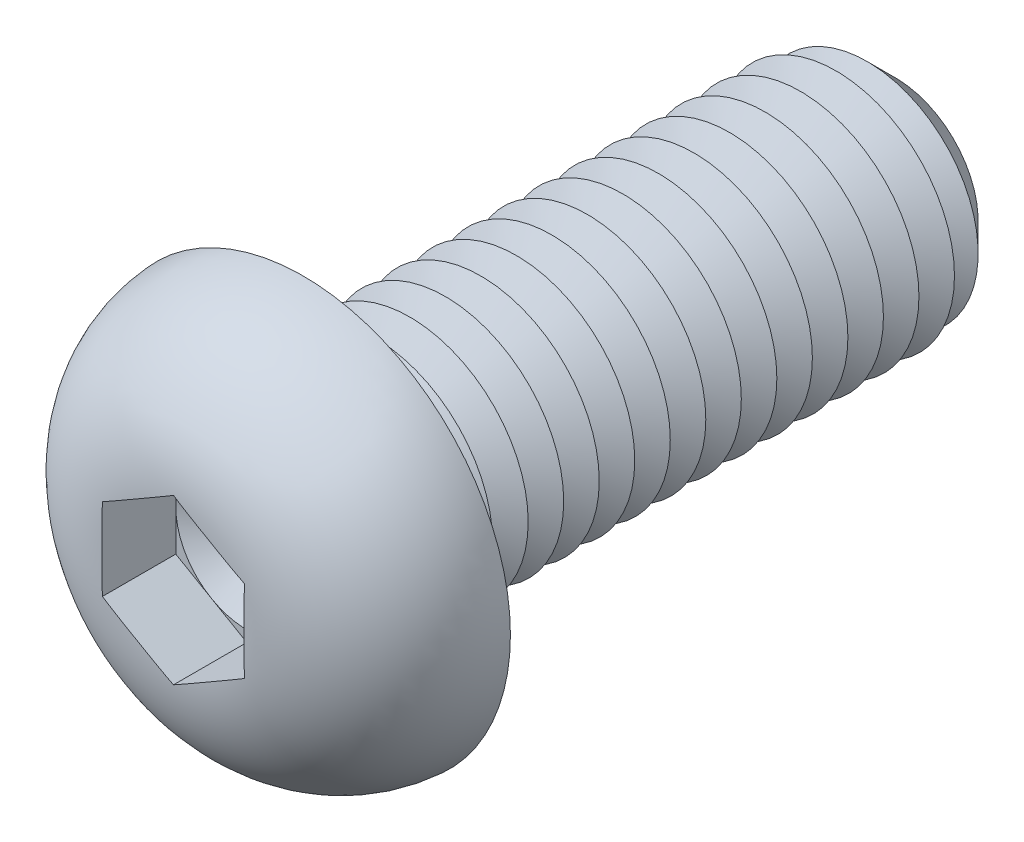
ISO-10303-21;
HEADER;
FILE_DESCRIPTION(('STEP AP214'),'2;1');
FILE_NAME('part.step','',(''),(''),'','','');
FILE_SCHEMA(('AUTOMOTIVE_DESIGN { 1 0 10303 214 1 1 1 1 }'));
ENDSEC;
DATA;
#1=APPLICATION_CONTEXT('core data for automotive mechanical design processes');
#2=APPLICATION_PROTOCOL_DEFINITION('international standard','automotive_design',2000,#1);
#3=PRODUCT_CONTEXT('',#1,'mechanical');
#4=PRODUCT('Part','Part','',(#3));
#5=PRODUCT_RELATED_PRODUCT_CATEGORY('part','',(#4));
#6=PRODUCT_DEFINITION_FORMATION('','',#4);
#7=PRODUCT_DEFINITION_CONTEXT('part definition',#1,'design');
#8=PRODUCT_DEFINITION('design','',#6,#7);
#9=PRODUCT_DEFINITION_SHAPE('','',#8);
#10=(LENGTH_UNIT() NAMED_UNIT(*) SI_UNIT(.MILLI.,.METRE.));
#11=(NAMED_UNIT(*) PLANE_ANGLE_UNIT() SI_UNIT($,.RADIAN.));
#12=(NAMED_UNIT(*) SI_UNIT($,.STERADIAN.) SOLID_ANGLE_UNIT());
#13=UNCERTAINTY_MEASURE_WITH_UNIT(LENGTH_MEASURE(1.E-05),#10,'distance_accuracy_value','');
#14=(GEOMETRIC_REPRESENTATION_CONTEXT(3) GLOBAL_UNCERTAINTY_ASSIGNED_CONTEXT((#13)) GLOBAL_UNIT_ASSIGNED_CONTEXT((#10,
#11,#12)) REPRESENTATION_CONTEXT('',''));
#15=CARTESIAN_POINT('',(0.,0.,0.));
#16=DIRECTION('',(0.,0.,1.));
#17=DIRECTION('',(1.,0.,0.));
#18=AXIS2_PLACEMENT_3D('',#15,#16,#17);
#19=CARTESIAN_POINT('',(0.,0.,2.38));
#20=DIRECTION('',(0.,0.,1.));
#21=DIRECTION('',(1.,0.,0.));
#22=AXIS2_PLACEMENT_3D('',#19,#20,#21);
#23=PLANE('',#22);
#24=CARTESIAN_POINT('',(0.,0.,2.38));
#25=DIRECTION('',(0.,0.,1.));
#26=DIRECTION('',(1.,0.,0.));
#27=AXIS2_PLACEMENT_3D('',#24,#25,#26);
#28=CIRCLE('',#27,3.);
#29=CARTESIAN_POINT('',(3.,0.,2.38));
#30=VERTEX_POINT('',#29);
#31=CARTESIAN_POINT('',(1.5,2.59807621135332,2.38));
#32=VERTEX_POINT('',#31);
#33=EDGE_CURVE('E117',#30,#32,#28,.T.);
#34=ORIENTED_EDGE('',*,*,#33,.F.);
#35=DIRECTION('',(0.,1.,0.));
#36=VECTOR('',#35,1.);
#37=CARTESIAN_POINT('',(3.,-1.73205080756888,2.38));
#38=LINE('',#37,#36);
#39=CARTESIAN_POINT('',(3.,1.73205080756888,2.38));
#40=VERTEX_POINT('',#39);
#41=EDGE_CURVE('E140',#30,#40,#38,.T.);
#42=ORIENTED_EDGE('',*,*,#41,.T.);
#43=DIRECTION('',(-0.866025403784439,0.5,0.));
#44=VECTOR('',#43,1.);
#45=CARTESIAN_POINT('',(3.,1.73205080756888,2.38));
#46=LINE('',#45,#44);
#47=EDGE_CURVE('E136',#40,#32,#46,.T.);
#48=ORIENTED_EDGE('',*,*,#47,.T.);
#49=EDGE_LOOP('',(#34,#42,#48));
#50=FACE_BOUND('',#49,.T.);
#51=ADVANCED_FACE('F39',(#50),#23,.T.);
#52=CARTESIAN_POINT('',(0.,0.,2.38));
#53=DIRECTION('',(0.,0.,1.));
#54=DIRECTION('',(1.,0.,0.));
#55=AXIS2_PLACEMENT_3D('',#52,#53,#54);
#56=CIRCLE('',#55,3.);
#57=CARTESIAN_POINT('',(-1.5,2.59807621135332,2.38));
#58=VERTEX_POINT('',#57);
#59=EDGE_CURVE('E11',#32,#58,#56,.T.);
#60=ORIENTED_EDGE('',*,*,#59,.F.);
#61=CARTESIAN_POINT('',(0.,3.46410161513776,2.38));
#62=VERTEX_POINT('',#61);
#63=EDGE_CURVE('E130',#32,#62,#46,.T.);
#64=ORIENTED_EDGE('',*,*,#63,.T.);
#65=DIRECTION('',(-0.866025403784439,-0.5,0.));
#66=VECTOR('',#65,1.);
#67=CARTESIAN_POINT('',(0.,3.46410161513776,2.38));
#68=LINE('',#67,#66);
#69=EDGE_CURVE('E131',#62,#58,#68,.T.);
#70=ORIENTED_EDGE('',*,*,#69,.T.);
#71=EDGE_LOOP('',(#60,#64,#70));
#72=FACE_BOUND('',#71,.T.);
#73=ADVANCED_FACE('F129',(#72),#23,.T.);
#74=CARTESIAN_POINT('',(-3.,0.,2.38));
#75=VERTEX_POINT('',#74);
#76=EDGE_CURVE('E49',#58,#75,#56,.T.);
#77=ORIENTED_EDGE('',*,*,#76,.F.);
#78=CARTESIAN_POINT('',(-3.,1.73205080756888,2.38));
#79=VERTEX_POINT('',#78);
#80=EDGE_CURVE('E143',#58,#79,#68,.T.);
#81=ORIENTED_EDGE('',*,*,#80,.T.);
#82=DIRECTION('',(0.,-1.,0.));
#83=VECTOR('',#82,1.);
#84=CARTESIAN_POINT('',(-3.,1.73205080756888,2.38));
#85=LINE('',#84,#83);
#86=EDGE_CURVE('E153',#79,#75,#85,.T.);
#87=ORIENTED_EDGE('',*,*,#86,.T.);
#88=EDGE_LOOP('',(#77,#81,#87));
#89=FACE_BOUND('',#88,.T.);
#90=ADVANCED_FACE('F276',(#89),#23,.T.);
#91=CARTESIAN_POINT('',(-1.5,-2.59807621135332,2.38));
#92=VERTEX_POINT('',#91);
#93=EDGE_CURVE('E260',#75,#92,#56,.T.);
#94=ORIENTED_EDGE('',*,*,#93,.F.);
#95=CARTESIAN_POINT('',(-3.,-1.73205080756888,2.38));
#96=VERTEX_POINT('',#95);
#97=EDGE_CURVE('E152',#75,#96,#85,.T.);
#98=ORIENTED_EDGE('',*,*,#97,.T.);
#99=DIRECTION('',(0.866025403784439,-0.5,0.));
#100=VECTOR('',#99,1.);
#101=CARTESIAN_POINT('',(-3.,-1.73205080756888,2.38));
#102=LINE('',#101,#100);
#103=EDGE_CURVE('E158',#96,#92,#102,.T.);
#104=ORIENTED_EDGE('',*,*,#103,.T.);
#105=EDGE_LOOP('',(#94,#98,#104));
#106=FACE_BOUND('',#105,.T.);
#107=ADVANCED_FACE('F270',(#106),#23,.T.);
#108=CARTESIAN_POINT('',(1.5,-2.59807621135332,2.38));
#109=VERTEX_POINT('',#108);
#110=EDGE_CURVE('E56',#92,#109,#56,.T.);
#111=ORIENTED_EDGE('',*,*,#110,.F.);
#112=CARTESIAN_POINT('',(0.,-3.46410161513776,2.38));
#113=VERTEX_POINT('',#112);
#114=EDGE_CURVE('E157',#92,#113,#102,.T.);
#115=ORIENTED_EDGE('',*,*,#114,.T.);
#116=DIRECTION('',(0.866025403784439,0.5,0.));
#117=VECTOR('',#116,1.);
#118=CARTESIAN_POINT('',(0.,-3.46410161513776,2.38));
#119=LINE('',#118,#117);
#120=EDGE_CURVE('E162',#113,#109,#119,.T.);
#121=ORIENTED_EDGE('',*,*,#120,.T.);
#122=EDGE_LOOP('',(#111,#115,#121));
#123=FACE_BOUND('',#122,.T.);
#124=ADVANCED_FACE('F311',(#123),#23,.T.);
#125=CARTESIAN_POINT('',(0.,0.,-25.));
#126=DIRECTION('',(0.,0.,1.));
#127=DIRECTION('',(1.,0.,0.));
#128=AXIS2_PLACEMENT_3D('',#125,#126,#127);
#129=CYLINDRICAL_SURFACE('',#128,5.);
#130=CARTESIAN_POINT('',(0.,0.,-0.6));
#131=DIRECTION('',(0.,0.,1.));
#132=DIRECTION('',(1.,0.,0.));
#133=AXIS2_PLACEMENT_3D('',#130,#131,#132);
#134=CIRCLE('',#133,5.);
#135=CARTESIAN_POINT('',(5.,0.,-0.6));
#136=VERTEX_POINT('',#135);
#137=EDGE_CURVE('E241',#136,#136,#134,.F.);
#138=ORIENTED_EDGE('',*,*,#137,.T.);
#139=EDGE_LOOP('',(#138));
#140=FACE_BOUND('',#139,.T.);
#141=CARTESIAN_POINT('',(0.,0.,-1.5));
#142=DIRECTION('',(0.,0.,1.));
#143=DIRECTION('',(1.,0.,0.));
#144=AXIS2_PLACEMENT_3D('',#141,#142,#143);
#145=CIRCLE('',#144,5.00000000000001);
#146=CARTESIAN_POINT('',(5.00000000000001,0.,-1.5));
#147=VERTEX_POINT('',#146);
#148=EDGE_CURVE('E138',#147,#147,#145,.T.);
#149=ORIENTED_EDGE('',*,*,#148,.T.);
#150=EDGE_LOOP('',(#149));
#151=FACE_BOUND('',#150,.T.);
#152=ADVANCED_FACE('F312',(#140,#151),#129,.T.);
#153=CARTESIAN_POINT('',(0.,8.75,0.));
#154=DIRECTION('',(0.,0.,1.));
#155=DIRECTION('',(1.,0.,0.));
#156=AXIS2_PLACEMENT_3D('',#153,#154,#155);
#157=PLANE('',#156);
#158=CARTESIAN_POINT('',(0.,0.,0.));
#159=DIRECTION('',(0.,0.,1.));
#160=DIRECTION('',(1.,0.,0.));
#161=AXIS2_PLACEMENT_3D('',#158,#159,#160);
#162=CIRCLE('',#161,5.6);
#163=CARTESIAN_POINT('',(5.6,0.,0.));
#164=VERTEX_POINT('',#163);
#165=EDGE_CURVE('E250',#164,#164,#162,.T.);
#166=ORIENTED_EDGE('',*,*,#165,.T.);
#167=EDGE_LOOP('',(#166));
#168=FACE_BOUND('',#167,.T.);
#169=CARTESIAN_POINT('',(0.,0.,0.));
#170=DIRECTION('',(0.,0.,1.));
#171=DIRECTION('',(1.,0.,0.));
#172=AXIS2_PLACEMENT_3D('',#169,#170,#171);
#173=CIRCLE('',#172,8.75);
#174=CARTESIAN_POINT('',(8.75,0.,0.));
#175=VERTEX_POINT('',#174);
#176=EDGE_CURVE('E173',#175,#175,#173,.T.);
#177=ORIENTED_EDGE('',*,*,#176,.F.);
#178=EDGE_LOOP('',(#177));
#179=FACE_BOUND('',#178,.T.);
#180=ADVANCED_FACE('F315',(#168,#179),#157,.F.);
#181=CARTESIAN_POINT('',(0.,0.,-0.3));
#182=DIRECTION('',(0.,0.,1.));
#183=DIRECTION('',(1.,0.,0.));
#184=AXIS2_PLACEMENT_3D('',#181,#182,#183);
#185=DEGENERATE_TOROIDAL_SURFACE('',#184,2.95776381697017,5.8,.T.);
#186=CARTESIAN_POINT('',(-3.0002,1.73193533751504,5.47784605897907));
#187=CARTESIAN_POINT('',(-2.87524340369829,1.80407906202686,5.4841525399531));
#188=CARTESIAN_POINT('',(-2.75023731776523,1.87625135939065,5.48853670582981));
#189=CARTESIAN_POINT('',(-2.5001955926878,2.02061301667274,5.49472046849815));
#190=CARTESIAN_POINT('',(-2.37515996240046,2.09280237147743,5.49652051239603));
#191=CARTESIAN_POINT('',(-2.12510741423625,2.23717027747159,5.4987972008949));
#192=CARTESIAN_POINT('',(-2.00009049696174,2.30934882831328,5.49927407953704));
#193=CARTESIAN_POINT('',(-1.75004905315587,2.45371032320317,5.49979859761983));
#194=CARTESIAN_POINT('',(-1.62502452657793,2.52589326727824,5.49984621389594));
#195=CARTESIAN_POINT('',(-1.37497547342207,2.67025915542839,5.49984621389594));
#196=CARTESIAN_POINT('',(-1.24995094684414,2.74244209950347,5.49979859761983));
#197=CARTESIAN_POINT('',(-0.999909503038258,2.88680359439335,5.49927407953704));
#198=CARTESIAN_POINT('',(-0.874892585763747,2.95898214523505,5.4987972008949));
#199=CARTESIAN_POINT('',(-0.624840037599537,3.10335005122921,5.49652051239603));
#200=CARTESIAN_POINT('',(-0.499804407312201,3.1755394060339,5.49472046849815));
#201=CARTESIAN_POINT('',(-0.249762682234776,3.31990106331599,5.48853670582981));
#202=CARTESIAN_POINT('',(-0.124756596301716,3.39207336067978,5.4841525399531));
#203=CARTESIAN_POINT('',(0.000199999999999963,3.46421708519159,5.47784605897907));
#204=B_SPLINE_CURVE_WITH_KNOTS('',3,(#186,#187,#188,#189,#190,#191,#192,#193,#194,#195,#196,
#197,#198,#199,#200,#201,#202,#203),.UNSPECIFIED.,.F.,.F.,(4,2,2,2,2,2,2,2,4),(0.,
0.433225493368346,0.866376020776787,1.29944992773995,1.73254720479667,2.16564448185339,
2.59871838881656,3.031868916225,3.46509440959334),.UNSPECIFIED.);
#205=CARTESIAN_POINT('',(-3.,1.73205080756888,5.4778561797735));
#206=VERTEX_POINT('',#205);
#207=CARTESIAN_POINT('',(0.,3.46410161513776,5.4778561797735));
#208=VERTEX_POINT('',#207);
#209=EDGE_CURVE('E195',#206,#208,#204,.T.);
#210=ORIENTED_EDGE('',*,*,#209,.T.);
#211=CARTESIAN_POINT('',(-0.000200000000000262,3.46421708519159,5.47784605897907));
#212=CARTESIAN_POINT('',(0.124756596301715,3.39207336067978,5.4841525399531));
#213=CARTESIAN_POINT('',(0.249762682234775,3.31990106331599,5.48853670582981));
#214=CARTESIAN_POINT('',(0.4998044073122,3.1755394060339,5.49472046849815));
#215=CARTESIAN_POINT('',(0.624840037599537,3.10335005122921,5.49652051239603));
#216=CARTESIAN_POINT('',(0.874892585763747,2.95898214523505,5.4987972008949));
#217=CARTESIAN_POINT('',(0.999909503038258,2.88680359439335,5.49927407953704));
#218=CARTESIAN_POINT('',(1.24995094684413,2.74244209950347,5.49979859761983));
#219=CARTESIAN_POINT('',(1.37497547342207,2.67025915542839,5.49984621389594));
#220=CARTESIAN_POINT('',(1.62502452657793,2.52589326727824,5.49984621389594));
#221=CARTESIAN_POINT('',(1.75004905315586,2.45371032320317,5.49979859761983));
#222=CARTESIAN_POINT('',(2.00009049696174,2.30934882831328,5.49927407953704));
#223=CARTESIAN_POINT('',(2.12510741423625,2.23717027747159,5.4987972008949));
#224=CARTESIAN_POINT('',(2.37515996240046,2.09280237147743,5.49652051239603));
#225=CARTESIAN_POINT('',(2.5001955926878,2.02061301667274,5.49472046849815));
#226=CARTESIAN_POINT('',(2.75023731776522,1.87625135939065,5.48853670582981));
#227=CARTESIAN_POINT('',(2.87524340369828,1.80407906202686,5.4841525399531));
#228=CARTESIAN_POINT('',(3.0002,1.73193533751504,5.47784605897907));
#229=B_SPLINE_CURVE_WITH_KNOTS('',3,(#211,#212,#213,#214,#215,#216,#217,#218,#219,#220,#221,
#222,#223,#224,#225,#226,#227,#228),.UNSPECIFIED.,.F.,.F.,(4,2,2,2,2,2,2,2,4),(0.,
0.433225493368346,0.866376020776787,1.29944992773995,1.73254720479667,2.16564448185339,
2.59871838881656,3.031868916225,3.46509440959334),.UNSPECIFIED.);
#230=CARTESIAN_POINT('',(3.,1.73205080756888,5.47785617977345));
#231=VERTEX_POINT('',#230);
#232=EDGE_CURVE('E224',#208,#231,#229,.T.);
#233=ORIENTED_EDGE('',*,*,#232,.T.);
#234=CARTESIAN_POINT('',(3.,0.,5.49984621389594));
#235=CARTESIAN_POINT('',(3.,-0.125570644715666,5.49984449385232));
#236=CARTESIAN_POINT('',(3.,-0.251141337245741,5.49980426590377));
#237=CARTESIAN_POINT('',(3.,-0.502283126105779,5.499449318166));
#238=CARTESIAN_POINT('',(3.,-0.62785422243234,5.49913459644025));
#239=CARTESIAN_POINT('',(3.,-0.879037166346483,5.49770394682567));
#240=CARTESIAN_POINT('',(3.,-1.00464901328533,5.49658774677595));
#241=CARTESIAN_POINT('',(3.,-1.2558477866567,5.49279605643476));
#242=CARTESIAN_POINT('',(3.,-1.38143471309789,5.49012056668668));
#243=CARTESIAN_POINT('',(3.,-1.7568847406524,5.47847778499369));
#244=CARTESIAN_POINT('',(3.,-2.00667103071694,5.46590367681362));
#245=CARTESIAN_POINT('',(3.,-2.50488375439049,5.42441448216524));
#246=CARTESIAN_POINT('',(3.,-2.75331093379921,5.3955095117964));
#247=CARTESIAN_POINT('',(3.,-3.18719021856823,5.32582626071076));
#248=CARTESIAN_POINT('',(3.,-3.3733635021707,5.28960049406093));
#249=CARTESIAN_POINT('',(3.,-3.74245496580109,5.20330651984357));
#250=CARTESIAN_POINT('',(3.,-3.92537417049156,5.15324275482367));
#251=CARTESIAN_POINT('',(3.,-4.28675502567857,5.03819885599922));
#252=CARTESIAN_POINT('',(3.,-4.46521058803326,4.97319946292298));
#253=CARTESIAN_POINT('',(3.,-4.81576789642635,4.82782766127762));
#254=CARTESIAN_POINT('',(3.,-4.98786985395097,4.74745576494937));
#255=CARTESIAN_POINT('',(3.,-5.3254008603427,4.5705398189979));
#256=CARTESIAN_POINT('',(3.,-5.49076268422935,4.47386710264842));
#257=CARTESIAN_POINT('',(3.,-5.81151175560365,4.26514040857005));
#258=CARTESIAN_POINT('',(3.,-5.96689840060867,4.15308550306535));
#259=CARTESIAN_POINT('',(3.,-6.26591787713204,3.91428862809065));
#260=CARTESIAN_POINT('',(3.,-6.40955257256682,3.78754899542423));
#261=CARTESIAN_POINT('',(3.,-6.68342295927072,3.52034797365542));
#262=CARTESIAN_POINT('',(3.,-6.81366070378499,3.3798886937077));
#263=CARTESIAN_POINT('',(3.,-7.0426666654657,3.10626157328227));
#264=CARTESIAN_POINT('',(3.,-7.1433109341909,2.97465879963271));
#265=CARTESIAN_POINT('',(3.,-7.33253056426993,2.70304716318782));
#266=CARTESIAN_POINT('',(3.,-7.42110686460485,2.56303895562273));
#267=CARTESIAN_POINT('',(3.,-7.58534868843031,2.27573732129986));
#268=CARTESIAN_POINT('',(3.,-7.66102067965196,2.12844759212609));
#269=CARTESIAN_POINT('',(3.,-7.79881901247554,1.82765987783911));
#270=CARTESIAN_POINT('',(3.,-7.86094563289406,1.67416202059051));
#271=CARTESIAN_POINT('',(3.,-7.96803488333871,1.37082076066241));
#272=CARTESIAN_POINT('',(3.,-8.01375687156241,1.22124490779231));
#273=CARTESIAN_POINT('',(3.,-8.09224398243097,0.918674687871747));
#274=CARTESIAN_POINT('',(3.,-8.12500479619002,0.765679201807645));
#275=CARTESIAN_POINT('',(3.,-8.17726457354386,0.457507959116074));
#276=CARTESIAN_POINT('',(3.,-8.1967692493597,0.302333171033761));
#277=CARTESIAN_POINT('',(3.,-8.22238322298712,-0.00917738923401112));
#278=CARTESIAN_POINT('',(3.,-8.22848754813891,-0.165513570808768));
#279=CARTESIAN_POINT('',(3.,-8.22724693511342,-0.475358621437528));
#280=CARTESIAN_POINT('',(3.,-8.2201384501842,-0.628868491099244));
#281=CARTESIAN_POINT('',(3.,-8.1929851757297,-0.934809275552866));
#282=CARTESIAN_POINT('',(3.,-8.17293462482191,-1.0872396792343));
#283=CARTESIAN_POINT('',(3.,-8.1200547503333,-1.38984943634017));
#284=CARTESIAN_POINT('',(3.,-8.08722683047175,-1.54002903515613));
#285=CARTESIAN_POINT('',(3.,-8.0090712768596,-1.83702738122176));
#286=CARTESIAN_POINT('',(3.,-7.96374919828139,-1.98384759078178));
#287=CARTESIAN_POINT('',(3.,-7.86096457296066,-2.27315566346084));
#288=CARTESIAN_POINT('',(3.,-7.80350334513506,-2.41564399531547));
#289=CARTESIAN_POINT('',(3.,-7.67691451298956,-2.6952770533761));
#290=CARTESIAN_POINT('',(3.,-7.60779108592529,-2.83242367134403));
#291=CARTESIAN_POINT('',(3.,-7.45837210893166,-3.10056990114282));
#292=CARTESIAN_POINT('',(3.,-7.37807144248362,-3.23156666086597));
#293=CARTESIAN_POINT('',(3.,-7.20697634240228,-3.48645411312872));
#294=CARTESIAN_POINT('',(3.,-7.11618520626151,-3.61034702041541));
#295=CARTESIAN_POINT('',(3.,-6.92334779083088,-3.85210954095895));
#296=CARTESIAN_POINT('',(3.,-6.82115263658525,-3.96986038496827));
#297=CARTESIAN_POINT('',(3.,-6.60745266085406,-4.19658717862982));
#298=CARTESIAN_POINT('',(3.,-6.49594754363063,-4.30556284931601));
#299=CARTESIAN_POINT('',(3.,-6.26450055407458,-4.51413072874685));
#300=CARTESIAN_POINT('',(3.,-6.14455919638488,-4.61372350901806));
#301=CARTESIAN_POINT('',(3.,-5.8971402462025,-4.80306090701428));
#302=CARTESIAN_POINT('',(3.,-5.76966228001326,-4.89280503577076));
#303=CARTESIAN_POINT('',(3.,-5.50268934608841,-5.06561354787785));
#304=CARTESIAN_POINT('',(3.,-5.36291526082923,-5.14824654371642));
#305=CARTESIAN_POINT('',(3.,-5.07726499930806,-5.30226841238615));
#306=CARTESIAN_POINT('',(3.,-4.93138704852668,-5.37365398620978));
#307=CARTESIAN_POINT('',(3.,-4.63484455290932,-5.50505544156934));
#308=CARTESIAN_POINT('',(3.,-4.48418671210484,-5.56508649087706));
#309=CARTESIAN_POINT('',(3.,-4.17906596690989,-5.6740700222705));
#310=CARTESIAN_POINT('',(3.,-4.02460600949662,-5.72303080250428));
#311=CARTESIAN_POINT('',(3.,-3.6739247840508,-5.82125760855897));
#312=CARTESIAN_POINT('',(3.,-3.47687521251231,-5.86756841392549));
#313=CARTESIAN_POINT('',(3.,-3.07981530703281,-5.94521593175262));
#314=CARTESIAN_POINT('',(3.,-2.87980357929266,-5.97654534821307));
#315=CARTESIAN_POINT('',(3.,-2.47751859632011,-6.02656554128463));
#316=CARTESIAN_POINT('',(3.,-2.27523974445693,-6.0452096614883));
#317=CARTESIAN_POINT('',(3.,-1.8700786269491,-6.07274849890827));
#318=CARTESIAN_POINT('',(3.,-1.66719636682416,-6.08164330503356));
#319=CARTESIAN_POINT('',(3.,-1.25887867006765,-6.09343726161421));
#320=CARTESIAN_POINT('',(3.,-1.05344157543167,-6.09626381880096));
#321=CARTESIAN_POINT('',(3.,-0.745285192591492,-6.0985660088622));
#322=CARTESIAN_POINT('',(3.,-0.642567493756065,-6.09901047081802));
#323=CARTESIAN_POINT('',(3.,-0.437131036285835,-6.09957976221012));
#324=CARTESIAN_POINT('',(3.,-0.334412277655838,-6.09970459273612));
#325=CARTESIAN_POINT('',(3.,-0.129132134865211,-6.09984385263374));
#326=CARTESIAN_POINT('',(3.,-0.0265707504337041,-6.09985845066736));
#327=CARTESIAN_POINT('',(3.,0.178552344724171,-6.09981980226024));
#328=CARTESIAN_POINT('',(3.,0.281114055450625,-6.09976655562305));
#329=CARTESIAN_POINT('',(3.,0.486235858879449,-6.09946703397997));
#330=CARTESIAN_POINT('',(3.,0.588795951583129,-6.0992207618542));
#331=CARTESIAN_POINT('',(3.,0.793913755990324,-6.09826017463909));
#332=CARTESIAN_POINT('',(3.,0.896471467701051,-6.097545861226));
#333=CARTESIAN_POINT('',(3.,1.11088851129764,-6.0951586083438));
#334=CARTESIAN_POINT('',(3.,1.22274716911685,-6.0934045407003));
#335=CARTESIAN_POINT('',(3.,1.44642575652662,-6.08829151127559));
#336=CARTESIAN_POINT('',(3.,1.55824568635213,-6.08493255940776));
#337=CARTESIAN_POINT('',(3.,1.89360474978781,-6.07150074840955));
#338=CARTESIAN_POINT('',(3.,2.11703989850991,-6.05807293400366));
#339=CARTESIAN_POINT('',(3.,2.56083256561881,-6.01778675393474));
#340=CARTESIAN_POINT('',(3.,2.78120000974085,-5.99104517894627));
#341=CARTESIAN_POINT('',(3.,3.2192866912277,-5.92065658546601));
#342=CARTESIAN_POINT('',(3.,3.43700630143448,-5.8770119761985));
#343=CARTESIAN_POINT('',(3.,3.82666678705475,-5.78060449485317));
#344=CARTESIAN_POINT('',(3.,3.99942726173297,-5.73116262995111));
#345=CARTESIAN_POINT('',(3.,4.3405567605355,-5.61888897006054));
#346=CARTESIAN_POINT('',(3.,4.50892617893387,-5.55605838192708));
#347=CARTESIAN_POINT('',(3.,4.84049143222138,-5.41635874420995));
#348=CARTESIAN_POINT('',(3.,5.00366586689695,-5.33943871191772));
#349=CARTESIAN_POINT('',(3.,5.32271829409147,-5.17167128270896));
#350=CARTESIAN_POINT('',(3.,5.47859600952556,-5.0808233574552));
#351=CARTESIAN_POINT('',(3.,5.7822829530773,-4.88500135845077));
#352=CARTESIAN_POINT('',(3.,5.93005015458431,-4.77996197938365));
#353=CARTESIAN_POINT('',(3.,6.21523046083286,-4.55663689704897));
#354=CARTESIAN_POINT('',(3.,6.35264336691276,-4.43835093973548));
#355=CARTESIAN_POINT('',(3.,6.61552762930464,-4.18948618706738));
#356=CARTESIAN_POINT('',(3.,6.74101380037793,-4.05892305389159));
#357=CARTESIAN_POINT('',(3.,6.97891308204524,-3.78639059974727));
#358=CARTESIAN_POINT('',(3.,7.09132750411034,-3.64442242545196));
#359=CARTESIAN_POINT('',(3.,7.29113623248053,-3.36530209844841));
#360=CARTESIAN_POINT('',(3.,7.37991316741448,-3.22913733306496));
#361=CARTESIAN_POINT('',(3.,7.5451968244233,-2.94955428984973));
#362=CARTESIAN_POINT('',(3.,7.62170419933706,-2.80613639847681));
#363=CARTESIAN_POINT('',(3.,7.76177641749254,-2.5131168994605));
#364=CARTESIAN_POINT('',(3.,7.82534152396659,-2.36351541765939));
#365=CARTESIAN_POINT('',(3.,7.93897019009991,-2.05926799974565));
#366=CARTESIAN_POINT('',(3.,7.98903395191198,-1.9046221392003));
#367=CARTESIAN_POINT('',(3.,8.07336540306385,-1.59821781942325));
#368=CARTESIAN_POINT('',(3.,8.10821878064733,-1.44662026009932));
#369=CARTESIAN_POINT('',(3.,8.16487862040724,-1.14095089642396));
#370=CARTESIAN_POINT('',(3.,8.18668070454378,-0.986878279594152));
#371=CARTESIAN_POINT('',(3.,8.21703234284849,-0.677515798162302));
#372=CARTESIAN_POINT('',(3.,8.22558889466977,-0.522226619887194));
#373=CARTESIAN_POINT('',(3.,8.22940229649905,-0.211427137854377));
#374=CARTESIAN_POINT('',(3.,8.22465425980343,-0.0559167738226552));
#375=CARTESIAN_POINT('',(3.,8.20204101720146,0.252033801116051));
#376=CARTESIAN_POINT('',(3.,8.18435378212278,0.404487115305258));
#377=CARTESIAN_POINT('',(3.,8.136196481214,0.707418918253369));
#378=CARTESIAN_POINT('',(3.,8.1057217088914,0.857896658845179));
#379=CARTESIAN_POINT('',(3.,8.03224632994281,1.15569567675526));
#380=CARTESIAN_POINT('',(3.,7.9892508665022,1.30301822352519));
#381=CARTESIAN_POINT('',(3.,7.89104818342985,1.59360769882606));
#382=CARTESIAN_POINT('',(3.,7.83583549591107,1.73687277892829));
#383=CARTESIAN_POINT('',(3.,7.71349498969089,2.01864020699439));
#384=CARTESIAN_POINT('',(3.,7.64633814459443,2.1571299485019));
#385=CARTESIAN_POINT('',(3.,7.50076383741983,2.42797950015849));
#386=CARTESIAN_POINT('',(3.,7.42235122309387,2.56034191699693));
#387=CARTESIAN_POINT('',(3.,7.25483284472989,2.8181715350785));
#388=CARTESIAN_POINT('',(3.,7.16572386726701,2.94363664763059));
#389=CARTESIAN_POINT('',(3.,6.9775559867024,3.1867979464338));
#390=CARTESIAN_POINT('',(3.,6.87850037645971,3.30449668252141));
#391=CARTESIAN_POINT('',(3.,6.66919743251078,3.53363644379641));
#392=CARTESIAN_POINT('',(3.,6.55877281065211,3.6449154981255));
#393=CARTESIAN_POINT('',(3.,6.32925753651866,3.85806320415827));
#394=CARTESIAN_POINT('',(3.,6.21016952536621,3.95993470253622));
#395=CARTESIAN_POINT('',(3.,5.96413069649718,4.15386505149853));
#396=CARTESIAN_POINT('',(3.,5.83717459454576,4.24591719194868));
#397=CARTESIAN_POINT('',(3.,5.5764653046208,4.41973423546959));
#398=CARTESIAN_POINT('',(3.,5.4427139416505,4.50150188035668));
#399=CARTESIAN_POINT('',(3.,5.16249709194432,4.65840017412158));
#400=CARTESIAN_POINT('',(3.,5.01573037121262,4.73299250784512));
#401=CARTESIAN_POINT('',(3.,4.71685583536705,4.87057528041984));
#402=CARTESIAN_POINT('',(3.,4.56474751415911,4.93356461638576));
#403=CARTESIAN_POINT('',(3.,4.25657035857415,5.04801407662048));
#404=CARTESIAN_POINT('',(3.,4.10050882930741,5.09949395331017));
#405=CARTESIAN_POINT('',(3.,3.78523286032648,5.19149003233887));
#406=CARTESIAN_POINT('',(3.,3.62601895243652,5.23200806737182));
#407=CARTESIAN_POINT('',(3.,3.32461902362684,5.29856444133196));
#408=CARTESIAN_POINT('',(3.,3.18268434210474,5.32575733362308));
#409=CARTESIAN_POINT('',(3.,2.89760844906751,5.3729307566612));
#410=CARTESIAN_POINT('',(3.,2.75446703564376,5.39291005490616));
#411=CARTESIAN_POINT('',(3.,2.46730946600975,5.42656527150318));
#412=CARTESIAN_POINT('',(3.,2.32329255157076,5.44023457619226));
#413=CARTESIAN_POINT('',(3.,2.03487642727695,5.46234228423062));
#414=CARTESIAN_POINT('',(3.,1.89047722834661,5.4707808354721));
#415=CARTESIAN_POINT('',(3.,1.60058090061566,5.48373897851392));
#416=CARTESIAN_POINT('',(3.,1.45508270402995,5.48823290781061));
#417=CARTESIAN_POINT('',(3.,1.16402671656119,5.49458098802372));
#418=CARTESIAN_POINT('',(3.,1.01846892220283,5.49643495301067));
#419=CARTESIAN_POINT('',(3.,0.72742451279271,5.49877506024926));
#420=CARTESIAN_POINT('',(3.,0.581937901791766,5.49926194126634));
#421=CARTESIAN_POINT('',(3.,0.290967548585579,5.49979850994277));
#422=CARTESIAN_POINT('',(3.,0.145483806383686,5.49984820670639));
#423=CARTESIAN_POINT('',(3.,0.,5.49984621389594));
#424=B_SPLINE_CURVE_WITH_KNOTS('',3,(#234,#235,#236,#237,#238,#239,#240,#241,#242,#243,#244,
#245,#246,#247,#248,#249,#250,#251,#252,#253,#254,#255,#256,#257,#258,#259,#260,#261,#262,#263,
#264,#265,#266,#267,#268,#269,#270,#271,#272,#273,#274,#275,#276,#277,#278,#279,#280,#281,#282,
#283,#284,#285,#286,#287,#288,#289,#290,#291,#292,#293,#294,#295,#296,#297,#298,#299,#300,#301,
#302,#303,#304,#305,#306,#307,#308,#309,#310,#311,#312,#313,#314,#315,#316,#317,#318,#319,#320,
#321,#322,#323,#324,#325,#326,#327,#328,#329,#330,#331,#332,#333,#334,#335,#336,#337,#338,#339,
#340,#341,#342,#343,#344,#345,#346,#347,#348,#349,#350,#351,#352,#353,#354,#355,#356,#357,#358,
#359,#360,#361,#362,#363,#364,#365,#366,#367,#368,#369,#370,#371,#372,#373,#374,#375,#376,#377,
#378,#379,#380,#381,#382,#383,#384,#385,#386,#387,#388,#389,#390,#391,#392,#393,#394,#395,#396,
#397,#398,#399,#400,#401,#402,#403,#404,#405,#406,#407,#408,#409,#410,#411,#412,#413,#414,#415,
#416,#417,#418,#419,#420,#421,#422,#423),.UNSPECIFIED.,.T.,.F.,(4,2,2,2,2,2,2,2,2,2,2,2,2,2,2,2,
2,2,2,2,2,2,2,2,2,2,2,2,2,2,2,2,2,2,2,2,2,2,2,2,2,2,2,2,2,2,2,2,2,2,2,2,2,2,2,2,2,2,2,2,2,2,2,2,
2,2,2,2,2,2,2,2,2,2,2,2,2,2,2,2,2,2,2,2,2,2,2,2,2,2,2,2,2,2,4),(0.,0.376711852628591,
0.753426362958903,1.13026885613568,1.50711121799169,2.257095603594,3.00661592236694,
3.57514719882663,4.14349616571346,4.71258216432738,5.28164920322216,5.85543852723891,
6.42926247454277,7.00299523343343,7.57663992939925,8.07303876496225,8.56939895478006,
9.06550962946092,9.56161009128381,10.030267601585,10.4990807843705,10.9676918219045,
11.4364767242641,11.8969530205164,12.3576344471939,12.8182652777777,13.2786916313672,
13.7390679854,14.1992797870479,14.6597029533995,15.1199817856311,15.5871904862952,
16.0544140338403,16.5216091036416,16.9888273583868,17.4754224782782,17.9621600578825,
18.4482427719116,18.9339599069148,19.5405320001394,20.1473991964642,20.7564865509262,
21.3655683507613,21.9818967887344,22.2900536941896,22.5982095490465,22.905893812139,
23.2135789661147,23.5212595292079,23.8289389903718,24.1645461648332,24.5001512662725,
25.171371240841,25.8368042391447,26.5021424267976,27.0407309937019,27.5792710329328,
28.119799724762,28.660348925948,29.2034761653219,29.7466138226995,30.2890677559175,
30.831467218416,31.3185063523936,31.8055195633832,32.2925228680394,32.779518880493,
33.2456153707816,33.7118681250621,34.1778744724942,34.6440520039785,35.103935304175,
35.563988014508,36.0238520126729,36.4839222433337,36.9451261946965,37.4061321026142,
37.8672768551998,38.3282694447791,38.7980460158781,39.2676799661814,39.7376328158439,
40.207460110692,40.7008436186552,41.1942739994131,41.6868509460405,42.1793454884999,
42.6126940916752,43.0461167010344,43.479992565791,43.9138561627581,44.3505218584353,
44.7872183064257,45.2236787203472,45.6601300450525),.UNSPECIFIED.);
#425=CARTESIAN_POINT('',(3.,-1.73205080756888,5.4778561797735));
#426=VERTEX_POINT('',#425);
#427=EDGE_CURVE('E233',#231,#426,#424,.T.);
#428=ORIENTED_EDGE('',*,*,#427,.T.);
#429=CARTESIAN_POINT('',(3.0002,-1.73193533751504,5.47784605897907));
#430=CARTESIAN_POINT('',(2.87524340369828,-1.80407906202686,5.4841525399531));
#431=CARTESIAN_POINT('',(2.75023731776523,-1.87625135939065,5.48853670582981));
#432=CARTESIAN_POINT('',(2.5001955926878,-2.02061301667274,5.49472046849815));
#433=CARTESIAN_POINT('',(2.37515996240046,-2.09280237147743,5.49652051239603));
#434=CARTESIAN_POINT('',(2.12510741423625,-2.23717027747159,5.4987972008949));
#435=CARTESIAN_POINT('',(2.00009049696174,-2.30934882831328,5.49927407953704));
#436=CARTESIAN_POINT('',(1.75004905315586,-2.45371032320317,5.49979859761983));
#437=CARTESIAN_POINT('',(1.62502452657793,-2.52589326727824,5.49984621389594));
#438=CARTESIAN_POINT('',(1.37497547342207,-2.67025915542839,5.49984621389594));
#439=CARTESIAN_POINT('',(1.24995094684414,-2.74244209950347,5.49979859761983));
#440=CARTESIAN_POINT('',(0.999909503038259,-2.88680359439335,5.49927407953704));
#441=CARTESIAN_POINT('',(0.874892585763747,-2.95898214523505,5.4987972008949));
#442=CARTESIAN_POINT('',(0.624840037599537,-3.10335005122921,5.49652051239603));
#443=CARTESIAN_POINT('',(0.499804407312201,-3.1755394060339,5.49472046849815));
#444=CARTESIAN_POINT('',(0.249762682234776,-3.31990106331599,5.48853670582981));
#445=CARTESIAN_POINT('',(0.124756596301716,-3.39207336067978,5.4841525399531));
#446=CARTESIAN_POINT('',(-0.000199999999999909,-3.46421708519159,5.47784605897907));
#447=B_SPLINE_CURVE_WITH_KNOTS('',3,(#429,#430,#431,#432,#433,#434,#435,#436,#437,#438,#439,
#440,#441,#442,#443,#444,#445,#446),.UNSPECIFIED.,.F.,.F.,(4,2,2,2,2,2,2,2,4),(0.,
0.433225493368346,0.866376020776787,1.29944992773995,1.73254720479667,2.16564448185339,
2.59871838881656,3.031868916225,3.46509440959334),.UNSPECIFIED.);
#448=CARTESIAN_POINT('',(0.,-3.46410161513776,5.4778561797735));
#449=VERTEX_POINT('',#448);
#450=EDGE_CURVE('E286',#426,#449,#447,.T.);
#451=ORIENTED_EDGE('',*,*,#450,.T.);
#452=CARTESIAN_POINT('',(0.000200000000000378,-3.46421708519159,5.47784605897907));
#453=CARTESIAN_POINT('',(-0.124756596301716,-3.39207336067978,5.4841525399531));
#454=CARTESIAN_POINT('',(-0.249762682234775,-3.31990106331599,5.48853670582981));
#455=CARTESIAN_POINT('',(-0.499804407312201,-3.1755394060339,5.49472046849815));
#456=CARTESIAN_POINT('',(-0.624840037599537,-3.10335005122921,5.49652051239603));
#457=CARTESIAN_POINT('',(-0.874892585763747,-2.95898214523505,5.4987972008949));
#458=CARTESIAN_POINT('',(-0.999909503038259,-2.88680359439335,5.49927407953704));
#459=CARTESIAN_POINT('',(-1.24995094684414,-2.74244209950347,5.49979859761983));
#460=CARTESIAN_POINT('',(-1.37497547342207,-2.67025915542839,5.49984621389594));
#461=CARTESIAN_POINT('',(-1.62502452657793,-2.52589326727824,5.49984621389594));
#462=CARTESIAN_POINT('',(-1.75004905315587,-2.45371032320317,5.49979859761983));
#463=CARTESIAN_POINT('',(-2.00009049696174,-2.30934882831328,5.49927407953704));
#464=CARTESIAN_POINT('',(-2.12510741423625,-2.23717027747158,5.4987972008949));
#465=CARTESIAN_POINT('',(-2.37515996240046,-2.09280237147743,5.49652051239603));
#466=CARTESIAN_POINT('',(-2.5001955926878,-2.02061301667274,5.49472046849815));
#467=CARTESIAN_POINT('',(-2.75023731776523,-1.87625135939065,5.48853670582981));
#468=CARTESIAN_POINT('',(-2.87524340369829,-1.80407906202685,5.4841525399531));
#469=CARTESIAN_POINT('',(-3.0002,-1.73193533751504,5.47784605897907));
#470=B_SPLINE_CURVE_WITH_KNOTS('',3,(#452,#453,#454,#455,#456,#457,#458,#459,#460,#461,#462,
#463,#464,#465,#466,#467,#468,#469),.UNSPECIFIED.,.F.,.F.,(4,2,2,2,2,2,2,2,4),(0.,
0.433225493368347,0.866376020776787,1.29944992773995,1.73254720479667,2.16564448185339,
2.59871838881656,3.031868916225,3.46509440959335),.UNSPECIFIED.);
#471=CARTESIAN_POINT('',(-3.,-1.73205080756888,5.47785617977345));
#472=VERTEX_POINT('',#471);
#473=EDGE_CURVE('E283',#449,#472,#470,.T.);
#474=ORIENTED_EDGE('',*,*,#473,.T.);
#475=CARTESIAN_POINT('',(-3.,0.,5.49984621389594));
#476=CARTESIAN_POINT('',(-3.,0.125570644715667,5.49984449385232));
#477=CARTESIAN_POINT('',(-3.,0.251141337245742,5.49980426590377));
#478=CARTESIAN_POINT('',(-3.,0.50228312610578,5.499449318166));
#479=CARTESIAN_POINT('',(-3.,0.627854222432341,5.49913459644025));
#480=CARTESIAN_POINT('',(-3.,0.879037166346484,5.49770394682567));
#481=CARTESIAN_POINT('',(-3.,1.00464901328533,5.49658774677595));
#482=CARTESIAN_POINT('',(-3.,1.2558477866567,5.49279605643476));
#483=CARTESIAN_POINT('',(-3.,1.3814347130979,5.49012056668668));
#484=CARTESIAN_POINT('',(-3.,1.7568847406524,5.47847778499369));
#485=CARTESIAN_POINT('',(-3.,2.00667103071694,5.46590367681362));
#486=CARTESIAN_POINT('',(-3.,2.50488375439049,5.42441448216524));
#487=CARTESIAN_POINT('',(-3.,2.75331093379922,5.3955095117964));
#488=CARTESIAN_POINT('',(-3.,3.18719021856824,5.32582626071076));
#489=CARTESIAN_POINT('',(-3.,3.3733635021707,5.28960049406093));
#490=CARTESIAN_POINT('',(-3.,3.74245496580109,5.20330651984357));
#491=CARTESIAN_POINT('',(-3.,3.92537417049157,5.15324275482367));
#492=CARTESIAN_POINT('',(-3.,4.28675502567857,5.03819885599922));
#493=CARTESIAN_POINT('',(-3.,4.46521058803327,4.97319946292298));
#494=CARTESIAN_POINT('',(-3.,4.81576789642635,4.82782766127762));
#495=CARTESIAN_POINT('',(-3.,4.98786985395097,4.74745576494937));
#496=CARTESIAN_POINT('',(-3.,5.3254008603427,4.5705398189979));
#497=CARTESIAN_POINT('',(-3.,5.49076268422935,4.47386710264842));
#498=CARTESIAN_POINT('',(-3.,5.81151175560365,4.26514040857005));
#499=CARTESIAN_POINT('',(-3.,5.96689840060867,4.15308550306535));
#500=CARTESIAN_POINT('',(-3.,6.26591787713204,3.91428862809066));
#501=CARTESIAN_POINT('',(-3.,6.40955257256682,3.78754899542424));
#502=CARTESIAN_POINT('',(-3.,6.68342295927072,3.52034797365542));
#503=CARTESIAN_POINT('',(-3.,6.81366070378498,3.3798886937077));
#504=CARTESIAN_POINT('',(-3.,7.0426666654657,3.10626157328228));
#505=CARTESIAN_POINT('',(-3.,7.14331093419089,2.97465879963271));
#506=CARTESIAN_POINT('',(-3.,7.33253056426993,2.70304716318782));
#507=CARTESIAN_POINT('',(-3.,7.42110686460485,2.56303895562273));
#508=CARTESIAN_POINT('',(-3.,7.58534868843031,2.27573732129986));
#509=CARTESIAN_POINT('',(-3.,7.66102067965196,2.12844759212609));
#510=CARTESIAN_POINT('',(-3.,7.79881901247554,1.82765987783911));
#511=CARTESIAN_POINT('',(-3.,7.86094563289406,1.67416202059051));
#512=CARTESIAN_POINT('',(-3.,7.96803488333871,1.37082076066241));
#513=CARTESIAN_POINT('',(-3.,8.01375687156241,1.22124490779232));
#514=CARTESIAN_POINT('',(-3.,8.09224398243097,0.918674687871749));
#515=CARTESIAN_POINT('',(-3.,8.12500479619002,0.765679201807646));
#516=CARTESIAN_POINT('',(-3.,8.17726457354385,0.457507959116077));
#517=CARTESIAN_POINT('',(-3.,8.1967692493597,0.302333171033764));
#518=CARTESIAN_POINT('',(-3.,8.22238322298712,-0.00917738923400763));
#519=CARTESIAN_POINT('',(-3.,8.22848754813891,-0.165513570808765));
#520=CARTESIAN_POINT('',(-3.,8.22724693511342,-0.475358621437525));
#521=CARTESIAN_POINT('',(-3.,8.2201384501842,-0.628868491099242));
#522=CARTESIAN_POINT('',(-3.,8.1929851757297,-0.934809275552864));
#523=CARTESIAN_POINT('',(-3.,8.17293462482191,-1.08723967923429));
#524=CARTESIAN_POINT('',(-3.,8.1200547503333,-1.38984943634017));
#525=CARTESIAN_POINT('',(-3.,8.08722683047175,-1.54002903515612));
#526=CARTESIAN_POINT('',(-3.,8.0090712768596,-1.83702738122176));
#527=CARTESIAN_POINT('',(-3.,7.96374919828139,-1.98384759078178));
#528=CARTESIAN_POINT('',(-3.,7.86096457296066,-2.27315566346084));
#529=CARTESIAN_POINT('',(-3.,7.80350334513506,-2.41564399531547));
#530=CARTESIAN_POINT('',(-3.,7.67691451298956,-2.69527705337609));
#531=CARTESIAN_POINT('',(-3.,7.60779108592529,-2.83242367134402));
#532=CARTESIAN_POINT('',(-3.,7.45837210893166,-3.10056990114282));
#533=CARTESIAN_POINT('',(-3.,7.37807144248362,-3.23156666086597));
#534=CARTESIAN_POINT('',(-3.,7.20697634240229,-3.48645411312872));
#535=CARTESIAN_POINT('',(-3.,7.11618520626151,-3.61034702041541));
#536=CARTESIAN_POINT('',(-3.,6.92334779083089,-3.85210954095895));
#537=CARTESIAN_POINT('',(-3.,6.82115263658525,-3.96986038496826));
#538=CARTESIAN_POINT('',(-3.,6.60745266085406,-4.19658717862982));
#539=CARTESIAN_POINT('',(-3.,6.49594754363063,-4.30556284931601));
#540=CARTESIAN_POINT('',(-3.,6.26450055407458,-4.51413072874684));
#541=CARTESIAN_POINT('',(-3.,6.14455919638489,-4.61372350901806));
#542=CARTESIAN_POINT('',(-3.,5.8971402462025,-4.80306090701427));
#543=CARTESIAN_POINT('',(-3.,5.76966228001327,-4.89280503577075));
#544=CARTESIAN_POINT('',(-3.,5.50268934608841,-5.06561354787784));
#545=CARTESIAN_POINT('',(-3.,5.36291526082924,-5.14824654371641));
#546=CARTESIAN_POINT('',(-3.,5.07726499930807,-5.30226841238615));
#547=CARTESIAN_POINT('',(-3.,4.93138704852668,-5.37365398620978));
#548=CARTESIAN_POINT('',(-3.,4.63484455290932,-5.50505544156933));
#549=CARTESIAN_POINT('',(-3.,4.48418671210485,-5.56508649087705));
#550=CARTESIAN_POINT('',(-3.,4.17906596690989,-5.6740700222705));
#551=CARTESIAN_POINT('',(-3.,4.02460600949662,-5.72303080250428));
#552=CARTESIAN_POINT('',(-3.,3.6739247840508,-5.82125760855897));
#553=CARTESIAN_POINT('',(-3.,3.47687521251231,-5.86756841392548));
#554=CARTESIAN_POINT('',(-3.,3.07981530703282,-5.94521593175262));
#555=CARTESIAN_POINT('',(-3.,2.87980357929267,-5.97654534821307));
#556=CARTESIAN_POINT('',(-3.,2.47751859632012,-6.02656554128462));
#557=CARTESIAN_POINT('',(-3.,2.27523974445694,-6.0452096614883));
#558=CARTESIAN_POINT('',(-3.,1.87007862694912,-6.07274849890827));
#559=CARTESIAN_POINT('',(-3.,1.66719636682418,-6.08164330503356));
#560=CARTESIAN_POINT('',(-3.,1.25887867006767,-6.09343726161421));
#561=CARTESIAN_POINT('',(-3.,1.05344157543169,-6.09626381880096));
#562=CARTESIAN_POINT('',(-3.,0.745285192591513,-6.0985660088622));
#563=CARTESIAN_POINT('',(-3.,0.642567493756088,-6.09901047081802));
#564=CARTESIAN_POINT('',(-3.,0.437131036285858,-6.09957976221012));
#565=CARTESIAN_POINT('',(-3.,0.334412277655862,-6.09970459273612));
#566=CARTESIAN_POINT('',(-3.,0.129132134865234,-6.09984385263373));
#567=CARTESIAN_POINT('',(-3.,0.0265707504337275,-6.09985845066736));
#568=CARTESIAN_POINT('',(-3.,-0.178552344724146,-6.09981980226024));
#569=CARTESIAN_POINT('',(-3.,-0.281114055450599,-6.09976655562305));
#570=CARTESIAN_POINT('',(-3.,-0.486235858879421,-6.09946703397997));
#571=CARTESIAN_POINT('',(-3.,-0.588795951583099,-6.0992207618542));
#572=CARTESIAN_POINT('',(-3.,-0.793913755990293,-6.09826017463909));
#573=CARTESIAN_POINT('',(-3.,-0.89647146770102,-6.097545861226));
#574=CARTESIAN_POINT('',(-3.,-1.11088851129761,-6.0951586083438));
#575=CARTESIAN_POINT('',(-3.,-1.22274716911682,-6.0934045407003));
#576=CARTESIAN_POINT('',(-3.,-1.44642575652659,-6.08829151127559));
#577=CARTESIAN_POINT('',(-3.,-1.55824568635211,-6.08493255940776));
#578=CARTESIAN_POINT('',(-3.,-1.89360474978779,-6.07150074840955));
#579=CARTESIAN_POINT('',(-3.,-2.11703989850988,-6.05807293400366));
#580=CARTESIAN_POINT('',(-3.,-2.56083256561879,-6.01778675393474));
#581=CARTESIAN_POINT('',(-3.,-2.78120000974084,-5.99104517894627));
#582=CARTESIAN_POINT('',(-3.,-3.21928669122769,-5.92065658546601));
#583=CARTESIAN_POINT('',(-3.,-3.43700630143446,-5.8770119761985));
#584=CARTESIAN_POINT('',(-3.,-3.82666678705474,-5.78060449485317));
#585=CARTESIAN_POINT('',(-3.,-3.99942726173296,-5.73116262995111));
#586=CARTESIAN_POINT('',(-3.,-4.34055676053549,-5.61888897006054));
#587=CARTESIAN_POINT('',(-3.,-4.50892617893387,-5.55605838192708));
#588=CARTESIAN_POINT('',(-3.,-4.84049143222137,-5.41635874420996));
#589=CARTESIAN_POINT('',(-3.,-5.00366586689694,-5.33943871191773));
#590=CARTESIAN_POINT('',(-3.,-5.32271829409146,-5.17167128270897));
#591=CARTESIAN_POINT('',(-3.,-5.47859600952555,-5.08082335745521));
#592=CARTESIAN_POINT('',(-3.,-5.78228295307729,-4.88500135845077));
#593=CARTESIAN_POINT('',(-3.,-5.9300501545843,-4.77996197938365));
#594=CARTESIAN_POINT('',(-3.,-6.21523046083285,-4.55663689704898));
#595=CARTESIAN_POINT('',(-3.,-6.35264336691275,-4.43835093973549));
#596=CARTESIAN_POINT('',(-3.,-6.61552762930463,-4.18948618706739));
#597=CARTESIAN_POINT('',(-3.,-6.74101380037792,-4.05892305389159));
#598=CARTESIAN_POINT('',(-3.,-6.97891308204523,-3.78639059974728));
#599=CARTESIAN_POINT('',(-3.,-7.09132750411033,-3.64442242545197));
#600=CARTESIAN_POINT('',(-3.,-7.29113623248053,-3.36530209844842));
#601=CARTESIAN_POINT('',(-3.,-7.37991316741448,-3.22913733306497));
#602=CARTESIAN_POINT('',(-3.,-7.54519682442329,-2.94955428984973));
#603=CARTESIAN_POINT('',(-3.,-7.62170419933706,-2.80613639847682));
#604=CARTESIAN_POINT('',(-3.,-7.76177641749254,-2.5131168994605));
#605=CARTESIAN_POINT('',(-3.,-7.82534152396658,-2.3635154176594));
#606=CARTESIAN_POINT('',(-3.,-7.93897019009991,-2.05926799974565));
#607=CARTESIAN_POINT('',(-3.,-7.98903395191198,-1.9046221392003));
#608=CARTESIAN_POINT('',(-3.,-8.07336540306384,-1.59821781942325));
#609=CARTESIAN_POINT('',(-3.,-8.10821878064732,-1.44662026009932));
#610=CARTESIAN_POINT('',(-3.,-8.16487862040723,-1.14095089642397));
#611=CARTESIAN_POINT('',(-3.,-8.18668070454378,-0.986878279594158));
#612=CARTESIAN_POINT('',(-3.,-8.21703234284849,-0.677515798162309));
#613=CARTESIAN_POINT('',(-3.,-8.22558889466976,-0.522226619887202));
#614=CARTESIAN_POINT('',(-3.,-8.22940229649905,-0.211427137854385));
#615=CARTESIAN_POINT('',(-3.,-8.22465425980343,-0.0559167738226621));
#616=CARTESIAN_POINT('',(-3.,-8.20204101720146,0.252033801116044));
#617=CARTESIAN_POINT('',(-3.,-8.18435378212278,0.40448711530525));
#618=CARTESIAN_POINT('',(-3.,-8.136196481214,0.707418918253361));
#619=CARTESIAN_POINT('',(-3.,-8.1057217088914,0.857896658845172));
#620=CARTESIAN_POINT('',(-3.,-8.03224632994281,1.15569567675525));
#621=CARTESIAN_POINT('',(-3.,-7.9892508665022,1.30301822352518));
#622=CARTESIAN_POINT('',(-3.,-7.89104818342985,1.59360769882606));
#623=CARTESIAN_POINT('',(-3.,-7.83583549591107,1.73687277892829));
#624=CARTESIAN_POINT('',(-3.,-7.71349498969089,2.01864020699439));
#625=CARTESIAN_POINT('',(-3.,-7.64633814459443,2.1571299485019));
#626=CARTESIAN_POINT('',(-3.,-7.50076383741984,2.42797950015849));
#627=CARTESIAN_POINT('',(-3.,-7.42235122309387,2.56034191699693));
#628=CARTESIAN_POINT('',(-3.,-7.25483284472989,2.81817153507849));
#629=CARTESIAN_POINT('',(-3.,-7.16572386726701,2.94363664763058));
#630=CARTESIAN_POINT('',(-3.,-6.97755598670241,3.1867979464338));
#631=CARTESIAN_POINT('',(-3.,-6.87850037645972,3.30449668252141));
#632=CARTESIAN_POINT('',(-3.,-6.66919743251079,3.53363644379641));
#633=CARTESIAN_POINT('',(-3.,-6.55877281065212,3.64491549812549));
#634=CARTESIAN_POINT('',(-3.,-6.32925753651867,3.85806320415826));
#635=CARTESIAN_POINT('',(-3.,-6.21016952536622,3.95993470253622));
#636=CARTESIAN_POINT('',(-3.,-5.96413069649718,4.15386505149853));
#637=CARTESIAN_POINT('',(-3.,-5.83717459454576,4.24591719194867));
#638=CARTESIAN_POINT('',(-3.,-5.5764653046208,4.41973423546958));
#639=CARTESIAN_POINT('',(-3.,-5.4427139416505,4.50150188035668));
#640=CARTESIAN_POINT('',(-3.,-5.16249709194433,4.65840017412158));
#641=CARTESIAN_POINT('',(-3.,-5.01573037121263,4.73299250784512));
#642=CARTESIAN_POINT('',(-3.,-4.71685583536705,4.87057528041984));
#643=CARTESIAN_POINT('',(-3.,-4.56474751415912,4.93356461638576));
#644=CARTESIAN_POINT('',(-3.,-4.25657035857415,5.04801407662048));
#645=CARTESIAN_POINT('',(-3.,-4.10050882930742,5.09949395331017));
#646=CARTESIAN_POINT('',(-3.,-3.78523286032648,5.19149003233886));
#647=CARTESIAN_POINT('',(-3.,-3.62601895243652,5.23200806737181));
#648=CARTESIAN_POINT('',(-3.,-3.32461902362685,5.29856444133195));
#649=CARTESIAN_POINT('',(-3.,-3.18268434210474,5.32575733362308));
#650=CARTESIAN_POINT('',(-3.,-2.89760844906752,5.3729307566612));
#651=CARTESIAN_POINT('',(-3.,-2.75446703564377,5.39291005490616));
#652=CARTESIAN_POINT('',(-3.,-2.46730946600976,5.42656527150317));
#653=CARTESIAN_POINT('',(-3.,-2.32329255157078,5.44023457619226));
#654=CARTESIAN_POINT('',(-3.,-2.03487642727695,5.46234228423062));
#655=CARTESIAN_POINT('',(-3.,-1.89047722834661,5.4707808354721));
#656=CARTESIAN_POINT('',(-3.,-1.60058090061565,5.48373897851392));
#657=CARTESIAN_POINT('',(-3.,-1.45508270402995,5.48823290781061));
#658=CARTESIAN_POINT('',(-3.,-1.16402671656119,5.49458098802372));
#659=CARTESIAN_POINT('',(-3.,-1.01846892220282,5.49643495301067));
#660=CARTESIAN_POINT('',(-3.,-0.727424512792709,5.49877506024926));
#661=CARTESIAN_POINT('',(-3.,-0.581937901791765,5.49926194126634));
#662=CARTESIAN_POINT('',(-3.,-0.290967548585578,5.49979850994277));
#663=CARTESIAN_POINT('',(-3.,-0.145483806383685,5.49984820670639));
#664=CARTESIAN_POINT('',(-3.,0.,5.49984621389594));
#665=B_SPLINE_CURVE_WITH_KNOTS('',3,(#475,#476,#477,#478,#479,#480,#481,#482,#483,#484,#485,
#486,#487,#488,#489,#490,#491,#492,#493,#494,#495,#496,#497,#498,#499,#500,#501,#502,#503,#504,
#505,#506,#507,#508,#509,#510,#511,#512,#513,#514,#515,#516,#517,#518,#519,#520,#521,#522,#523,
#524,#525,#526,#527,#528,#529,#530,#531,#532,#533,#534,#535,#536,#537,#538,#539,#540,#541,#542,
#543,#544,#545,#546,#547,#548,#549,#550,#551,#552,#553,#554,#555,#556,#557,#558,#559,#560,#561,
#562,#563,#564,#565,#566,#567,#568,#569,#570,#571,#572,#573,#574,#575,#576,#577,#578,#579,#580,
#581,#582,#583,#584,#585,#586,#587,#588,#589,#590,#591,#592,#593,#594,#595,#596,#597,#598,#599,
#600,#601,#602,#603,#604,#605,#606,#607,#608,#609,#610,#611,#612,#613,#614,#615,#616,#617,#618,
#619,#620,#621,#622,#623,#624,#625,#626,#627,#628,#629,#630,#631,#632,#633,#634,#635,#636,#637,
#638,#639,#640,#641,#642,#643,#644,#645,#646,#647,#648,#649,#650,#651,#652,#653,#654,#655,#656,
#657,#658,#659,#660,#661,#662,#663,#664),.UNSPECIFIED.,.T.,.F.,(4,2,2,2,2,2,2,2,2,2,2,2,2,2,2,2,
2,2,2,2,2,2,2,2,2,2,2,2,2,2,2,2,2,2,2,2,2,2,2,2,2,2,2,2,2,2,2,2,2,2,2,2,2,2,2,2,2,2,2,2,2,2,2,2,
2,2,2,2,2,2,2,2,2,2,2,2,2,2,2,2,2,2,2,2,2,2,2,2,2,2,2,2,2,2,4),(0.,0.376711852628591,
0.753426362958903,1.13026885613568,1.50711121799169,2.257095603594,3.00661592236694,
3.57514719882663,4.14349616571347,4.71258216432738,5.28164920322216,5.85543852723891,
6.42926247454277,7.00299523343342,7.57663992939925,8.07303876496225,8.56939895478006,
9.06550962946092,9.56161009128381,10.030267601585,10.4990807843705,10.9676918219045,
11.4364767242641,11.8969530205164,12.3576344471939,12.8182652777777,13.2786916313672,
13.7390679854,14.1992797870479,14.6597029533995,15.1199817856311,15.5871904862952,
16.0544140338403,16.5216091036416,16.9888273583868,17.4754224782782,17.9621600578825,
18.4482427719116,18.9339599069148,19.5405320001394,20.1473991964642,20.7564865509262,
21.3655683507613,21.9818967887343,22.2900536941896,22.5982095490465,22.905893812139,
23.2135789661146,23.5212595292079,23.8289389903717,24.1645461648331,24.5001512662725,
25.171371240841,25.8368042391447,26.5021424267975,27.0407309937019,27.5792710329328,
28.1197997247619,28.6603489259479,29.2034761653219,29.7466138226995,30.2890677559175,
30.831467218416,31.3185063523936,31.8055195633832,32.2925228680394,32.779518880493,
33.2456153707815,33.711868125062,34.1778744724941,34.6440520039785,35.103935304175,
35.563988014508,36.0238520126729,36.4839222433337,36.9451261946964,37.4061321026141,
37.8672768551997,38.3282694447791,38.798046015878,39.2676799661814,39.7376328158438,
40.207460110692,40.7008436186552,41.194273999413,41.6868509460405,42.1793454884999,
42.6126940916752,43.0461167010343,43.479992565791,43.913856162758,44.3505218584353,
44.7872183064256,45.2236787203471,45.6601300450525),.UNSPECIFIED.);
#666=EDGE_CURVE('E204',#472,#206,#665,.T.);
#667=ORIENTED_EDGE('',*,*,#666,.T.);
#668=EDGE_LOOP('',(#210,#233,#428,#451,#474,#667));
#669=FACE_BOUND('',#668,.T.);
#670=ORIENTED_EDGE('',*,*,#176,.T.);
#671=EDGE_LOOP('',(#670));
#672=FACE_BOUND('',#671,.T.);
#673=ADVANCED_FACE('F209',(#669,#672),#185,.T.);
#674=CARTESIAN_POINT('',(3.,1.73205080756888,2.38));
#675=DIRECTION('',(0.5,0.866025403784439,0.));
#676=DIRECTION('',(-0.866025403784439,0.5,0.));
#677=AXIS2_PLACEMENT_3D('',#674,#675,#676);
#678=PLANE('',#677);
#679=DIRECTION('',(0.,0.,1.));
#680=VECTOR('',#679,1.);
#681=CARTESIAN_POINT('',(0.,3.46410161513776,2.38));
#682=LINE('',#681,#680);
#683=EDGE_CURVE('E64',#62,#208,#682,.T.);
#684=ORIENTED_EDGE('',*,*,#683,.F.);
#685=ORIENTED_EDGE('',*,*,#63,.F.);
#686=ORIENTED_EDGE('',*,*,#47,.F.);
#687=DIRECTION('',(0.,0.,1.));
#688=VECTOR('',#687,1.);
#689=CARTESIAN_POINT('',(3.,1.73205080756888,2.38));
#690=LINE('',#689,#688);
#691=EDGE_CURVE('E170',#40,#231,#690,.T.);
#692=ORIENTED_EDGE('',*,*,#691,.T.);
#693=ORIENTED_EDGE('',*,*,#232,.F.);
#694=EDGE_LOOP('',(#684,#685,#686,#692,#693));
#695=FACE_BOUND('',#694,.T.);
#696=ADVANCED_FACE('F134',(#695),#678,.F.);
#697=CARTESIAN_POINT('',(3.,-1.73205080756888,2.38));
#698=DIRECTION('',(1.,0.,0.));
#699=DIRECTION('',(0.,1.,0.));
#700=AXIS2_PLACEMENT_3D('',#697,#698,#699);
#701=PLANE('',#700);
#702=ORIENTED_EDGE('',*,*,#691,.F.);
#703=ORIENTED_EDGE('',*,*,#41,.F.);
#704=CARTESIAN_POINT('',(3.,-1.73205080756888,2.38));
#705=VERTEX_POINT('',#704);
#706=EDGE_CURVE('E166',#705,#30,#38,.T.);
#707=ORIENTED_EDGE('',*,*,#706,.F.);
#708=DIRECTION('',(0.,0.,1.));
#709=VECTOR('',#708,1.);
#710=CARTESIAN_POINT('',(3.,-1.73205080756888,2.38));
#711=LINE('',#710,#709);
#712=EDGE_CURVE('E174',#705,#426,#711,.T.);
#713=ORIENTED_EDGE('',*,*,#712,.T.);
#714=ORIENTED_EDGE('',*,*,#427,.F.);
#715=EDGE_LOOP('',(#702,#703,#707,#713,#714));
#716=FACE_BOUND('',#715,.T.);
#717=ADVANCED_FACE('F222',(#716),#701,.F.);
#718=CARTESIAN_POINT('',(0.,-3.46410161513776,2.38));
#719=DIRECTION('',(0.5,-0.866025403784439,0.));
#720=DIRECTION('',(0.866025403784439,0.5,0.));
#721=AXIS2_PLACEMENT_3D('',#718,#719,#720);
#722=PLANE('',#721);
#723=ORIENTED_EDGE('',*,*,#712,.F.);
#724=EDGE_CURVE('E161',#109,#705,#119,.T.);
#725=ORIENTED_EDGE('',*,*,#724,.F.);
#726=ORIENTED_EDGE('',*,*,#120,.F.);
#727=DIRECTION('',(0.,0.,1.));
#728=VECTOR('',#727,1.);
#729=CARTESIAN_POINT('',(0.,-3.46410161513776,2.38));
#730=LINE('',#729,#728);
#731=EDGE_CURVE('E178',#113,#449,#730,.T.);
#732=ORIENTED_EDGE('',*,*,#731,.T.);
#733=ORIENTED_EDGE('',*,*,#450,.F.);
#734=EDGE_LOOP('',(#723,#725,#726,#732,#733));
#735=FACE_BOUND('',#734,.T.);
#736=ADVANCED_FACE('F298',(#735),#722,.F.);
#737=CARTESIAN_POINT('',(-3.,-1.73205080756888,2.38));
#738=DIRECTION('',(-0.5,-0.866025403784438,0.));
#739=DIRECTION('',(0.866025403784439,-0.5,0.));
#740=AXIS2_PLACEMENT_3D('',#737,#738,#739);
#741=PLANE('',#740);
#742=ORIENTED_EDGE('',*,*,#731,.F.);
#743=ORIENTED_EDGE('',*,*,#114,.F.);
#744=ORIENTED_EDGE('',*,*,#103,.F.);
#745=DIRECTION('',(0.,0.,1.));
#746=VECTOR('',#745,1.);
#747=CARTESIAN_POINT('',(-3.,-1.73205080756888,2.38));
#748=LINE('',#747,#746);
#749=EDGE_CURVE('E182',#96,#472,#748,.T.);
#750=ORIENTED_EDGE('',*,*,#749,.T.);
#751=ORIENTED_EDGE('',*,*,#473,.F.);
#752=EDGE_LOOP('',(#742,#743,#744,#750,#751));
#753=FACE_BOUND('',#752,.T.);
#754=ADVANCED_FACE('F295',(#753),#741,.F.);
#755=CARTESIAN_POINT('',(-3.,1.73205080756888,2.38));
#756=DIRECTION('',(-1.,0.,0.));
#757=DIRECTION('',(0.,-1.,0.));
#758=AXIS2_PLACEMENT_3D('',#755,#756,#757);
#759=PLANE('',#758);
#760=ORIENTED_EDGE('',*,*,#749,.F.);
#761=ORIENTED_EDGE('',*,*,#97,.F.);
#762=ORIENTED_EDGE('',*,*,#86,.F.);
#763=DIRECTION('',(0.,0.,1.));
#764=VECTOR('',#763,1.);
#765=CARTESIAN_POINT('',(-3.,1.73205080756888,2.38));
#766=LINE('',#765,#764);
#767=EDGE_CURVE('E186',#79,#206,#766,.T.);
#768=ORIENTED_EDGE('',*,*,#767,.T.);
#769=ORIENTED_EDGE('',*,*,#666,.F.);
#770=EDGE_LOOP('',(#760,#761,#762,#768,#769));
#771=FACE_BOUND('',#770,.T.);
#772=ADVANCED_FACE('F217',(#771),#759,.F.);
#773=CARTESIAN_POINT('',(0.,3.46410161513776,2.38));
#774=DIRECTION('',(-0.5,0.866025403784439,0.));
#775=DIRECTION('',(-0.866025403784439,-0.5,0.));
#776=AXIS2_PLACEMENT_3D('',#773,#774,#775);
#777=PLANE('',#776);
#778=ORIENTED_EDGE('',*,*,#767,.F.);
#779=ORIENTED_EDGE('',*,*,#80,.F.);
#780=ORIENTED_EDGE('',*,*,#69,.F.);
#781=ORIENTED_EDGE('',*,*,#683,.T.);
#782=ORIENTED_EDGE('',*,*,#209,.F.);
#783=EDGE_LOOP('',(#778,#779,#780,#781,#782));
#784=FACE_BOUND('',#783,.T.);
#785=ADVANCED_FACE('F213',(#784),#777,.F.);
#786=EDGE_CURVE('E43',#109,#30,#56,.T.);
#787=ORIENTED_EDGE('',*,*,#786,.F.);
#788=ORIENTED_EDGE('',*,*,#724,.T.);
#789=ORIENTED_EDGE('',*,*,#706,.T.);
#790=EDGE_LOOP('',(#787,#788,#789));
#791=FACE_BOUND('',#790,.T.);
#792=ADVANCED_FACE('F216',(#791),#23,.T.);
#793=CARTESIAN_POINT('',(0.,0.,-1.5));
#794=DIRECTION('',(0.,0.,1.));
#795=DIRECTION('',(1.,0.,0.));
#796=AXIS2_PLACEMENT_3D('',#793,#794,#795);
#797=CONICAL_SURFACE('',#796,5.00000000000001,1.0471975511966);
#798=CARTESIAN_POINT('',(0.,0.,-2.25));
#799=DIRECTION('',(0.,0.,1.));
#800=DIRECTION('',(1.,0.,0.));
#801=AXIS2_PLACEMENT_3D('',#798,#799,#800);
#802=CIRCLE('',#801,3.70096189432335);
#803=CARTESIAN_POINT('',(3.70096189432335,0.,-2.25));
#804=VERTEX_POINT('',#803);
#805=EDGE_CURVE('E475',#804,#804,#802,.T.);
#806=ORIENTED_EDGE('',*,*,#805,.T.);
#807=EDGE_LOOP('',(#806));
#808=FACE_BOUND('',#807,.T.);
#809=ORIENTED_EDGE('',*,*,#148,.F.);
#810=EDGE_LOOP('',(#809));
#811=FACE_BOUND('',#810,.T.);
#812=ADVANCED_FACE('F309',(#808,#811),#797,.T.);
#813=CARTESIAN_POINT('',(0.,0.,-2.25));
#814=DIRECTION('',(0.,0.,-1.));
#815=DIRECTION('',(-1.,0.,0.));
#816=AXIS2_PLACEMENT_3D('',#813,#814,#815);
#817=CONICAL_SURFACE('',#816,3.70096189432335,1.0471975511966);
#818=CARTESIAN_POINT('',(0.,0.,-3.));
#819=DIRECTION('',(0.,0.,1.));
#820=DIRECTION('',(1.,0.,0.));
#821=AXIS2_PLACEMENT_3D('',#818,#819,#820);
#822=CIRCLE('',#821,5.00000000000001);
#823=CARTESIAN_POINT('',(5.00000000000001,0.,-3.));
#824=VERTEX_POINT('',#823);
#825=EDGE_CURVE('E479',#824,#824,#822,.T.);
#826=ORIENTED_EDGE('',*,*,#825,.T.);
#827=EDGE_LOOP('',(#826));
#828=FACE_BOUND('',#827,.T.);
#829=ORIENTED_EDGE('',*,*,#805,.F.);
#830=EDGE_LOOP('',(#829));
#831=FACE_BOUND('',#830,.T.);
#832=ADVANCED_FACE('F325',(#828,#831),#817,.T.);
#833=CARTESIAN_POINT('',(0.,0.,-3.));
#834=DIRECTION('',(0.,0.,1.));
#835=DIRECTION('',(1.,0.,0.));
#836=AXIS2_PLACEMENT_3D('',#833,#834,#835);
#837=CONICAL_SURFACE('',#836,5.00000000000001,1.0471975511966);
#838=CARTESIAN_POINT('',(0.,0.,-3.75));
#839=DIRECTION('',(0.,0.,1.));
#840=DIRECTION('',(1.,0.,0.));
#841=AXIS2_PLACEMENT_3D('',#838,#839,#840);
#842=CIRCLE('',#841,3.70096189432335);
#843=CARTESIAN_POINT('',(3.70096189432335,0.,-3.75));
#844=VERTEX_POINT('',#843);
#845=EDGE_CURVE('E468',#844,#844,#842,.T.);
#846=ORIENTED_EDGE('',*,*,#845,.T.);
#847=EDGE_LOOP('',(#846));
#848=FACE_BOUND('',#847,.T.);
#849=ORIENTED_EDGE('',*,*,#825,.F.);
#850=EDGE_LOOP('',(#849));
#851=FACE_BOUND('',#850,.T.);
#852=ADVANCED_FACE('F329',(#848,#851),#837,.T.);
#853=CARTESIAN_POINT('',(0.,0.,-3.75));
#854=DIRECTION('',(0.,0.,-1.));
#855=DIRECTION('',(-1.,0.,0.));
#856=AXIS2_PLACEMENT_3D('',#853,#854,#855);
#857=CONICAL_SURFACE('',#856,3.70096189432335,1.0471975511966);
#858=CARTESIAN_POINT('',(0.,0.,-4.5));
#859=DIRECTION('',(0.,0.,1.));
#860=DIRECTION('',(1.,0.,0.));
#861=AXIS2_PLACEMENT_3D('',#858,#859,#860);
#862=CIRCLE('',#861,5.00000000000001);
#863=CARTESIAN_POINT('',(5.00000000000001,0.,-4.5));
#864=VERTEX_POINT('',#863);
#865=EDGE_CURVE('E465',#864,#864,#862,.T.);
#866=ORIENTED_EDGE('',*,*,#865,.T.);
#867=EDGE_LOOP('',(#866));
#868=FACE_BOUND('',#867,.T.);
#869=ORIENTED_EDGE('',*,*,#845,.F.);
#870=EDGE_LOOP('',(#869));
#871=FACE_BOUND('',#870,.T.);
#872=ADVANCED_FACE('F333',(#868,#871),#857,.T.);
#873=CARTESIAN_POINT('',(0.,0.,-4.5));
#874=DIRECTION('',(0.,0.,1.));
#875=DIRECTION('',(1.,0.,0.));
#876=AXIS2_PLACEMENT_3D('',#873,#874,#875);
#877=CONICAL_SURFACE('',#876,5.00000000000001,1.0471975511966);
#878=CARTESIAN_POINT('',(0.,0.,-5.25));
#879=DIRECTION('',(0.,0.,1.));
#880=DIRECTION('',(1.,0.,0.));
#881=AXIS2_PLACEMENT_3D('',#878,#879,#880);
#882=CIRCLE('',#881,3.70096189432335);
#883=CARTESIAN_POINT('',(3.70096189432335,0.,-5.25));
#884=VERTEX_POINT('',#883);
#885=EDGE_CURVE('E469',#884,#884,#882,.T.);
#886=ORIENTED_EDGE('',*,*,#885,.T.);
#887=EDGE_LOOP('',(#886));
#888=FACE_BOUND('',#887,.T.);
#889=ORIENTED_EDGE('',*,*,#865,.F.);
#890=EDGE_LOOP('',(#889));
#891=FACE_BOUND('',#890,.T.);
#892=ADVANCED_FACE('F337',(#888,#891),#877,.T.);
#893=CARTESIAN_POINT('',(0.,0.,-5.25));
#894=DIRECTION('',(0.,0.,-1.));
#895=DIRECTION('',(-1.,0.,0.));
#896=AXIS2_PLACEMENT_3D('',#893,#894,#895);
#897=CONICAL_SURFACE('',#896,3.70096189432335,1.0471975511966);
#898=CARTESIAN_POINT('',(0.,0.,-6.));
#899=DIRECTION('',(0.,0.,1.));
#900=DIRECTION('',(1.,0.,0.));
#901=AXIS2_PLACEMENT_3D('',#898,#899,#900);
#902=CIRCLE('',#901,5.00000000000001);
#903=CARTESIAN_POINT('',(5.00000000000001,0.,-6.));
#904=VERTEX_POINT('',#903);
#905=EDGE_CURVE('E547',#904,#904,#902,.T.);
#906=ORIENTED_EDGE('',*,*,#905,.T.);
#907=EDGE_LOOP('',(#906));
#908=FACE_BOUND('',#907,.T.);
#909=ORIENTED_EDGE('',*,*,#885,.F.);
#910=EDGE_LOOP('',(#909));
#911=FACE_BOUND('',#910,.T.);
#912=ADVANCED_FACE('F341',(#908,#911),#897,.T.);
#913=CARTESIAN_POINT('',(0.,0.,-6.));
#914=DIRECTION('',(0.,0.,1.));
#915=DIRECTION('',(1.,0.,0.));
#916=AXIS2_PLACEMENT_3D('',#913,#914,#915);
#917=CONICAL_SURFACE('',#916,5.00000000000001,1.0471975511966);
#918=CARTESIAN_POINT('',(0.,0.,-6.75));
#919=DIRECTION('',(0.,0.,1.));
#920=DIRECTION('',(1.,0.,0.));
#921=AXIS2_PLACEMENT_3D('',#918,#919,#920);
#922=CIRCLE('',#921,3.70096189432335);
#923=CARTESIAN_POINT('',(3.70096189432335,0.,-6.75));
#924=VERTEX_POINT('',#923);
#925=EDGE_CURVE('E543',#924,#924,#922,.T.);
#926=ORIENTED_EDGE('',*,*,#925,.T.);
#927=EDGE_LOOP('',(#926));
#928=FACE_BOUND('',#927,.T.);
#929=ORIENTED_EDGE('',*,*,#905,.F.);
#930=EDGE_LOOP('',(#929));
#931=FACE_BOUND('',#930,.T.);
#932=ADVANCED_FACE('F345',(#928,#931),#917,.T.);
#933=CARTESIAN_POINT('',(0.,0.,-6.75));
#934=DIRECTION('',(0.,0.,-1.));
#935=DIRECTION('',(-1.,0.,0.));
#936=AXIS2_PLACEMENT_3D('',#933,#934,#935);
#937=CONICAL_SURFACE('',#936,3.70096189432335,1.0471975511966);
#938=CARTESIAN_POINT('',(0.,0.,-7.5));
#939=DIRECTION('',(0.,0.,1.));
#940=DIRECTION('',(1.,0.,0.));
#941=AXIS2_PLACEMENT_3D('',#938,#939,#940);
#942=CIRCLE('',#941,5.00000000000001);
#943=CARTESIAN_POINT('',(5.00000000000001,0.,-7.5));
#944=VERTEX_POINT('',#943);
#945=EDGE_CURVE('E539',#944,#944,#942,.T.);
#946=ORIENTED_EDGE('',*,*,#945,.T.);
#947=EDGE_LOOP('',(#946));
#948=FACE_BOUND('',#947,.T.);
#949=ORIENTED_EDGE('',*,*,#925,.F.);
#950=EDGE_LOOP('',(#949));
#951=FACE_BOUND('',#950,.T.);
#952=ADVANCED_FACE('F349',(#948,#951),#937,.T.);
#953=CARTESIAN_POINT('',(0.,0.,-7.5));
#954=DIRECTION('',(0.,0.,1.));
#955=DIRECTION('',(1.,0.,0.));
#956=AXIS2_PLACEMENT_3D('',#953,#954,#955);
#957=CONICAL_SURFACE('',#956,5.00000000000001,1.0471975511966);
#958=CARTESIAN_POINT('',(0.,0.,-8.25));
#959=DIRECTION('',(0.,0.,1.));
#960=DIRECTION('',(1.,0.,0.));
#961=AXIS2_PLACEMENT_3D('',#958,#959,#960);
#962=CIRCLE('',#961,3.70096189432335);
#963=CARTESIAN_POINT('',(3.70096189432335,0.,-8.25));
#964=VERTEX_POINT('',#963);
#965=EDGE_CURVE('E535',#964,#964,#962,.T.);
#966=ORIENTED_EDGE('',*,*,#965,.T.);
#967=EDGE_LOOP('',(#966));
#968=FACE_BOUND('',#967,.T.);
#969=ORIENTED_EDGE('',*,*,#945,.F.);
#970=EDGE_LOOP('',(#969));
#971=FACE_BOUND('',#970,.T.);
#972=ADVANCED_FACE('F353',(#968,#971),#957,.T.);
#973=CARTESIAN_POINT('',(0.,0.,-8.25));
#974=DIRECTION('',(0.,0.,-1.));
#975=DIRECTION('',(-1.,0.,0.));
#976=AXIS2_PLACEMENT_3D('',#973,#974,#975);
#977=CONICAL_SURFACE('',#976,3.70096189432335,1.0471975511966);
#978=CARTESIAN_POINT('',(0.,0.,-9.));
#979=DIRECTION('',(0.,0.,1.));
#980=DIRECTION('',(1.,0.,0.));
#981=AXIS2_PLACEMENT_3D('',#978,#979,#980);
#982=CIRCLE('',#981,5.00000000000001);
#983=CARTESIAN_POINT('',(5.00000000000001,0.,-9.));
#984=VERTEX_POINT('',#983);
#985=EDGE_CURVE('E483',#984,#984,#982,.T.);
#986=ORIENTED_EDGE('',*,*,#985,.T.);
#987=EDGE_LOOP('',(#986));
#988=FACE_BOUND('',#987,.T.);
#989=ORIENTED_EDGE('',*,*,#965,.F.);
#990=EDGE_LOOP('',(#989));
#991=FACE_BOUND('',#990,.T.);
#992=ADVANCED_FACE('F357',(#988,#991),#977,.T.);
#993=CARTESIAN_POINT('',(0.,0.,-9.));
#994=DIRECTION('',(0.,0.,1.));
#995=DIRECTION('',(1.,0.,0.));
#996=AXIS2_PLACEMENT_3D('',#993,#994,#995);
#997=CONICAL_SURFACE('',#996,5.00000000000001,1.0471975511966);
#998=CARTESIAN_POINT('',(0.,0.,-9.75));
#999=DIRECTION('',(0.,0.,1.));
#1000=DIRECTION('',(1.,0.,0.));
#1001=AXIS2_PLACEMENT_3D('',#998,#999,#1000);
#1002=CIRCLE('',#1001,3.70096189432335);
#1003=CARTESIAN_POINT('',(3.70096189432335,0.,-9.75));
#1004=VERTEX_POINT('',#1003);
#1005=EDGE_CURVE('E480',#1004,#1004,#1002,.T.);
#1006=ORIENTED_EDGE('',*,*,#1005,.T.);
#1007=EDGE_LOOP('',(#1006));
#1008=FACE_BOUND('',#1007,.T.);
#1009=ORIENTED_EDGE('',*,*,#985,.F.);
#1010=EDGE_LOOP('',(#1009));
#1011=FACE_BOUND('',#1010,.T.);
#1012=ADVANCED_FACE('F361',(#1008,#1011),#997,.T.);
#1013=CARTESIAN_POINT('',(0.,0.,-9.75));
#1014=DIRECTION('',(0.,0.,-1.));
#1015=DIRECTION('',(-1.,0.,0.));
#1016=AXIS2_PLACEMENT_3D('',#1013,#1014,#1015);
#1017=CONICAL_SURFACE('',#1016,3.70096189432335,1.0471975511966);
#1018=CARTESIAN_POINT('',(0.,0.,-10.5));
#1019=DIRECTION('',(0.,0.,1.));
#1020=DIRECTION('',(1.,0.,0.));
#1021=AXIS2_PLACEMENT_3D('',#1018,#1019,#1020);
#1022=CIRCLE('',#1021,5.00000000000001);
#1023=CARTESIAN_POINT('',(5.00000000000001,0.,-10.5));
#1024=VERTEX_POINT('',#1023);
#1025=EDGE_CURVE('E484',#1024,#1024,#1022,.T.);
#1026=ORIENTED_EDGE('',*,*,#1025,.T.);
#1027=EDGE_LOOP('',(#1026));
#1028=FACE_BOUND('',#1027,.T.);
#1029=ORIENTED_EDGE('',*,*,#1005,.F.);
#1030=EDGE_LOOP('',(#1029));
#1031=FACE_BOUND('',#1030,.T.);
#1032=ADVANCED_FACE('F365',(#1028,#1031),#1017,.T.);
#1033=CARTESIAN_POINT('',(0.,0.,-10.5));
#1034=DIRECTION('',(0.,0.,1.));
#1035=DIRECTION('',(1.,0.,0.));
#1036=AXIS2_PLACEMENT_3D('',#1033,#1034,#1035);
#1037=CONICAL_SURFACE('',#1036,5.00000000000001,1.0471975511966);
#1038=CARTESIAN_POINT('',(0.,0.,-11.25));
#1039=DIRECTION('',(0.,0.,1.));
#1040=DIRECTION('',(1.,0.,0.));
#1041=AXIS2_PLACEMENT_3D('',#1038,#1039,#1040);
#1042=CIRCLE('',#1041,3.70096189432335);
#1043=CARTESIAN_POINT('',(3.70096189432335,0.,-11.25));
#1044=VERTEX_POINT('',#1043);
#1045=EDGE_CURVE('E525',#1044,#1044,#1042,.T.);
#1046=ORIENTED_EDGE('',*,*,#1045,.T.);
#1047=EDGE_LOOP('',(#1046));
#1048=FACE_BOUND('',#1047,.T.);
#1049=ORIENTED_EDGE('',*,*,#1025,.F.);
#1050=EDGE_LOOP('',(#1049));
#1051=FACE_BOUND('',#1050,.T.);
#1052=ADVANCED_FACE('F369',(#1048,#1051),#1037,.T.);
#1053=CARTESIAN_POINT('',(0.,0.,-11.25));
#1054=DIRECTION('',(0.,0.,-1.));
#1055=DIRECTION('',(-1.,0.,0.));
#1056=AXIS2_PLACEMENT_3D('',#1053,#1054,#1055);
#1057=CONICAL_SURFACE('',#1056,3.70096189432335,1.0471975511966);
#1058=CARTESIAN_POINT('',(0.,0.,-12.));
#1059=DIRECTION('',(0.,0.,1.));
#1060=DIRECTION('',(1.,0.,0.));
#1061=AXIS2_PLACEMENT_3D('',#1058,#1059,#1060);
#1062=CIRCLE('',#1061,5.00000000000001);
#1063=CARTESIAN_POINT('',(5.00000000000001,0.,-12.));
#1064=VERTEX_POINT('',#1063);
#1065=EDGE_CURVE('E521',#1064,#1064,#1062,.T.);
#1066=ORIENTED_EDGE('',*,*,#1065,.T.);
#1067=EDGE_LOOP('',(#1066));
#1068=FACE_BOUND('',#1067,.T.);
#1069=ORIENTED_EDGE('',*,*,#1045,.F.);
#1070=EDGE_LOOP('',(#1069));
#1071=FACE_BOUND('',#1070,.T.);
#1072=ADVANCED_FACE('F373',(#1068,#1071),#1057,.T.);
#1073=CARTESIAN_POINT('',(0.,0.,-12.));
#1074=DIRECTION('',(0.,0.,1.));
#1075=DIRECTION('',(1.,0.,0.));
#1076=AXIS2_PLACEMENT_3D('',#1073,#1074,#1075);
#1077=CONICAL_SURFACE('',#1076,5.00000000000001,1.0471975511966);
#1078=CARTESIAN_POINT('',(0.,0.,-12.75));
#1079=DIRECTION('',(0.,0.,1.));
#1080=DIRECTION('',(1.,0.,0.));
#1081=AXIS2_PLACEMENT_3D('',#1078,#1079,#1080);
#1082=CIRCLE('',#1081,3.70096189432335);
#1083=CARTESIAN_POINT('',(3.70096189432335,0.,-12.75));
#1084=VERTEX_POINT('',#1083);
#1085=EDGE_CURVE('E517',#1084,#1084,#1082,.T.);
#1086=ORIENTED_EDGE('',*,*,#1085,.T.);
#1087=EDGE_LOOP('',(#1086));
#1088=FACE_BOUND('',#1087,.T.);
#1089=ORIENTED_EDGE('',*,*,#1065,.F.);
#1090=EDGE_LOOP('',(#1089));
#1091=FACE_BOUND('',#1090,.T.);
#1092=ADVANCED_FACE('F377',(#1088,#1091),#1077,.T.);
#1093=CARTESIAN_POINT('',(0.,0.,-12.75));
#1094=DIRECTION('',(0.,0.,-1.));
#1095=DIRECTION('',(-1.,0.,0.));
#1096=AXIS2_PLACEMENT_3D('',#1093,#1094,#1095);
#1097=CONICAL_SURFACE('',#1096,3.70096189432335,1.0471975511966);
#1098=CARTESIAN_POINT('',(0.,0.,-13.5));
#1099=DIRECTION('',(0.,0.,1.));
#1100=DIRECTION('',(1.,0.,0.));
#1101=AXIS2_PLACEMENT_3D('',#1098,#1099,#1100);
#1102=CIRCLE('',#1101,5.00000000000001);
#1103=CARTESIAN_POINT('',(5.00000000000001,0.,-13.5));
#1104=VERTEX_POINT('',#1103);
#1105=EDGE_CURVE('E513',#1104,#1104,#1102,.T.);
#1106=ORIENTED_EDGE('',*,*,#1105,.T.);
#1107=EDGE_LOOP('',(#1106));
#1108=FACE_BOUND('',#1107,.T.);
#1109=ORIENTED_EDGE('',*,*,#1085,.F.);
#1110=EDGE_LOOP('',(#1109));
#1111=FACE_BOUND('',#1110,.T.);
#1112=ADVANCED_FACE('F381',(#1108,#1111),#1097,.T.);
#1113=CARTESIAN_POINT('',(0.,0.,-13.5));
#1114=DIRECTION('',(0.,0.,1.));
#1115=DIRECTION('',(1.,0.,0.));
#1116=AXIS2_PLACEMENT_3D('',#1113,#1114,#1115);
#1117=CONICAL_SURFACE('',#1116,5.00000000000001,1.0471975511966);
#1118=CARTESIAN_POINT('',(0.,0.,-14.25));
#1119=DIRECTION('',(0.,0.,1.));
#1120=DIRECTION('',(1.,0.,0.));
#1121=AXIS2_PLACEMENT_3D('',#1118,#1119,#1120);
#1122=CIRCLE('',#1121,3.70096189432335);
#1123=CARTESIAN_POINT('',(3.70096189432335,0.,-14.25));
#1124=VERTEX_POINT('',#1123);
#1125=EDGE_CURVE('E509',#1124,#1124,#1122,.T.);
#1126=ORIENTED_EDGE('',*,*,#1125,.T.);
#1127=EDGE_LOOP('',(#1126));
#1128=FACE_BOUND('',#1127,.T.);
#1129=ORIENTED_EDGE('',*,*,#1105,.F.);
#1130=EDGE_LOOP('',(#1129));
#1131=FACE_BOUND('',#1130,.T.);
#1132=ADVANCED_FACE('F385',(#1128,#1131),#1117,.T.);
#1133=CARTESIAN_POINT('',(0.,0.,-14.25));
#1134=DIRECTION('',(0.,0.,-1.));
#1135=DIRECTION('',(-1.,0.,0.));
#1136=AXIS2_PLACEMENT_3D('',#1133,#1134,#1135);
#1137=CONICAL_SURFACE('',#1136,3.70096189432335,1.0471975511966);
#1138=CARTESIAN_POINT('',(0.,0.,-15.));
#1139=DIRECTION('',(0.,0.,1.));
#1140=DIRECTION('',(1.,0.,0.));
#1141=AXIS2_PLACEMENT_3D('',#1138,#1139,#1140);
#1142=CIRCLE('',#1141,5.00000000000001);
#1143=CARTESIAN_POINT('',(5.00000000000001,0.,-15.));
#1144=VERTEX_POINT('',#1143);
#1145=EDGE_CURVE('E505',#1144,#1144,#1142,.T.);
#1146=ORIENTED_EDGE('',*,*,#1145,.T.);
#1147=EDGE_LOOP('',(#1146));
#1148=FACE_BOUND('',#1147,.T.);
#1149=ORIENTED_EDGE('',*,*,#1125,.F.);
#1150=EDGE_LOOP('',(#1149));
#1151=FACE_BOUND('',#1150,.T.);
#1152=ADVANCED_FACE('F389',(#1148,#1151),#1137,.T.);
#1153=CARTESIAN_POINT('',(0.,0.,-15.));
#1154=DIRECTION('',(0.,0.,1.));
#1155=DIRECTION('',(1.,0.,0.));
#1156=AXIS2_PLACEMENT_3D('',#1153,#1154,#1155);
#1157=CONICAL_SURFACE('',#1156,5.00000000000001,1.0471975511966);
#1158=CARTESIAN_POINT('',(0.,0.,-15.75));
#1159=DIRECTION('',(0.,0.,1.));
#1160=DIRECTION('',(1.,0.,0.));
#1161=AXIS2_PLACEMENT_3D('',#1158,#1159,#1160);
#1162=CIRCLE('',#1161,3.70096189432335);
#1163=CARTESIAN_POINT('',(3.70096189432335,0.,-15.75));
#1164=VERTEX_POINT('',#1163);
#1165=EDGE_CURVE('E494',#1164,#1164,#1162,.T.);
#1166=ORIENTED_EDGE('',*,*,#1165,.T.);
#1167=EDGE_LOOP('',(#1166));
#1168=FACE_BOUND('',#1167,.T.);
#1169=ORIENTED_EDGE('',*,*,#1145,.F.);
#1170=EDGE_LOOP('',(#1169));
#1171=FACE_BOUND('',#1170,.T.);
#1172=ADVANCED_FACE('F393',(#1168,#1171),#1157,.T.);
#1173=CARTESIAN_POINT('',(0.,0.,-15.75));
#1174=DIRECTION('',(0.,0.,-1.));
#1175=DIRECTION('',(-1.,0.,0.));
#1176=AXIS2_PLACEMENT_3D('',#1173,#1174,#1175);
#1177=CONICAL_SURFACE('',#1176,3.70096189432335,1.0471975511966);
#1178=CARTESIAN_POINT('',(0.,0.,-16.5));
#1179=DIRECTION('',(0.,0.,1.));
#1180=DIRECTION('',(1.,0.,0.));
#1181=AXIS2_PLACEMENT_3D('',#1178,#1179,#1180);
#1182=CIRCLE('',#1181,5.00000000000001);
#1183=CARTESIAN_POINT('',(5.00000000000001,0.,-16.5));
#1184=VERTEX_POINT('',#1183);
#1185=EDGE_CURVE('E488',#1184,#1184,#1182,.T.);
#1186=ORIENTED_EDGE('',*,*,#1185,.T.);
#1187=EDGE_LOOP('',(#1186));
#1188=FACE_BOUND('',#1187,.T.);
#1189=ORIENTED_EDGE('',*,*,#1165,.F.);
#1190=EDGE_LOOP('',(#1189));
#1191=FACE_BOUND('',#1190,.T.);
#1192=ADVANCED_FACE('F397',(#1188,#1191),#1177,.T.);
#1193=CARTESIAN_POINT('',(0.,0.,-16.5));
#1194=DIRECTION('',(0.,0.,1.));
#1195=DIRECTION('',(1.,0.,0.));
#1196=AXIS2_PLACEMENT_3D('',#1193,#1194,#1195);
#1197=CONICAL_SURFACE('',#1196,5.00000000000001,1.0471975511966);
#1198=CARTESIAN_POINT('',(0.,0.,-17.25));
#1199=DIRECTION('',(0.,0.,1.));
#1200=DIRECTION('',(1.,0.,0.));
#1201=AXIS2_PLACEMENT_3D('',#1198,#1199,#1200);
#1202=CIRCLE('',#1201,3.70096189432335);
#1203=CARTESIAN_POINT('',(3.70096189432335,0.,-17.25));
#1204=VERTEX_POINT('',#1203);
#1205=EDGE_CURVE('E486',#1204,#1204,#1202,.T.);
#1206=ORIENTED_EDGE('',*,*,#1205,.T.);
#1207=EDGE_LOOP('',(#1206));
#1208=FACE_BOUND('',#1207,.T.);
#1209=ORIENTED_EDGE('',*,*,#1185,.F.);
#1210=EDGE_LOOP('',(#1209));
#1211=FACE_BOUND('',#1210,.T.);
#1212=ADVANCED_FACE('F401',(#1208,#1211),#1197,.T.);
#1213=CARTESIAN_POINT('',(0.,0.,-17.25));
#1214=DIRECTION('',(0.,0.,-1.));
#1215=DIRECTION('',(-1.,0.,0.));
#1216=AXIS2_PLACEMENT_3D('',#1213,#1214,#1215);
#1217=CONICAL_SURFACE('',#1216,3.70096189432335,1.0471975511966);
#1218=CARTESIAN_POINT('',(0.,0.,-18.));
#1219=DIRECTION('',(0.,0.,1.));
#1220=DIRECTION('',(1.,0.,0.));
#1221=AXIS2_PLACEMENT_3D('',#1218,#1219,#1220);
#1222=CIRCLE('',#1221,5.00000000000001);
#1223=CARTESIAN_POINT('',(5.00000000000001,0.,-18.));
#1224=VERTEX_POINT('',#1223);
#1225=EDGE_CURVE('E489',#1224,#1224,#1222,.T.);
#1226=ORIENTED_EDGE('',*,*,#1225,.T.);
#1227=EDGE_LOOP('',(#1226));
#1228=FACE_BOUND('',#1227,.T.);
#1229=ORIENTED_EDGE('',*,*,#1205,.F.);
#1230=EDGE_LOOP('',(#1229));
#1231=FACE_BOUND('',#1230,.T.);
#1232=ADVANCED_FACE('F405',(#1228,#1231),#1217,.T.);
#1233=CARTESIAN_POINT('',(0.,0.,-18.));
#1234=DIRECTION('',(0.,0.,1.));
#1235=DIRECTION('',(1.,0.,0.));
#1236=AXIS2_PLACEMENT_3D('',#1233,#1234,#1235);
#1237=CONICAL_SURFACE('',#1236,5.00000000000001,1.0471975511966);
#1238=CARTESIAN_POINT('',(0.,0.,-18.75));
#1239=DIRECTION('',(0.,0.,1.));
#1240=DIRECTION('',(1.,0.,0.));
#1241=AXIS2_PLACEMENT_3D('',#1238,#1239,#1240);
#1242=CIRCLE('',#1241,3.70096189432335);
#1243=CARTESIAN_POINT('',(3.70096189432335,0.,-18.75));
#1244=VERTEX_POINT('',#1243);
#1245=EDGE_CURVE('E498',#1244,#1244,#1242,.T.);
#1246=ORIENTED_EDGE('',*,*,#1245,.T.);
#1247=EDGE_LOOP('',(#1246));
#1248=FACE_BOUND('',#1247,.T.);
#1249=ORIENTED_EDGE('',*,*,#1225,.F.);
#1250=EDGE_LOOP('',(#1249));
#1251=FACE_BOUND('',#1250,.T.);
#1252=ADVANCED_FACE('F409',(#1248,#1251),#1237,.T.);
#1253=CARTESIAN_POINT('',(0.,0.,-18.75));
#1254=DIRECTION('',(0.,0.,-1.));
#1255=DIRECTION('',(-1.,0.,0.));
#1256=AXIS2_PLACEMENT_3D('',#1253,#1254,#1255);
#1257=CONICAL_SURFACE('',#1256,3.70096189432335,1.0471975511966);
#1258=CARTESIAN_POINT('',(0.,0.,-19.5));
#1259=DIRECTION('',(0.,0.,1.));
#1260=DIRECTION('',(1.,0.,0.));
#1261=AXIS2_PLACEMENT_3D('',#1258,#1259,#1260);
#1262=CIRCLE('',#1261,5.00000000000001);
#1263=CARTESIAN_POINT('',(5.00000000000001,0.,-19.5));
#1264=VERTEX_POINT('',#1263);
#1265=EDGE_CURVE('E565',#1264,#1264,#1262,.T.);
#1266=ORIENTED_EDGE('',*,*,#1265,.T.);
#1267=EDGE_LOOP('',(#1266));
#1268=FACE_BOUND('',#1267,.T.);
#1269=ORIENTED_EDGE('',*,*,#1245,.F.);
#1270=EDGE_LOOP('',(#1269));
#1271=FACE_BOUND('',#1270,.T.);
#1272=ADVANCED_FACE('F413',(#1268,#1271),#1257,.T.);
#1273=CARTESIAN_POINT('',(0.,0.,-19.5));
#1274=DIRECTION('',(0.,0.,1.));
#1275=DIRECTION('',(1.,0.,0.));
#1276=AXIS2_PLACEMENT_3D('',#1273,#1274,#1275);
#1277=CONICAL_SURFACE('',#1276,5.00000000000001,1.0471975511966);
#1278=CARTESIAN_POINT('',(0.,0.,-20.25));
#1279=DIRECTION('',(0.,0.,1.));
#1280=DIRECTION('',(1.,0.,0.));
#1281=AXIS2_PLACEMENT_3D('',#1278,#1279,#1280);
#1282=CIRCLE('',#1281,3.70096189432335);
#1283=CARTESIAN_POINT('',(3.70096189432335,0.,-20.25));
#1284=VERTEX_POINT('',#1283);
#1285=EDGE_CURVE('E567',#1284,#1284,#1282,.T.);
#1286=ORIENTED_EDGE('',*,*,#1285,.T.);
#1287=EDGE_LOOP('',(#1286));
#1288=FACE_BOUND('',#1287,.T.);
#1289=ORIENTED_EDGE('',*,*,#1265,.F.);
#1290=EDGE_LOOP('',(#1289));
#1291=FACE_BOUND('',#1290,.T.);
#1292=ADVANCED_FACE('F417',(#1288,#1291),#1277,.T.);
#1293=CARTESIAN_POINT('',(0.,0.,-20.25));
#1294=DIRECTION('',(0.,0.,-1.));
#1295=DIRECTION('',(-1.,0.,0.));
#1296=AXIS2_PLACEMENT_3D('',#1293,#1294,#1295);
#1297=CONICAL_SURFACE('',#1296,3.70096189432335,1.0471975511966);
#1298=CARTESIAN_POINT('',(0.,0.,-21.));
#1299=DIRECTION('',(0.,0.,1.));
#1300=DIRECTION('',(1.,0.,0.));
#1301=AXIS2_PLACEMENT_3D('',#1298,#1299,#1300);
#1302=CIRCLE('',#1301,5.00000000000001);
#1303=CARTESIAN_POINT('',(5.00000000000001,0.,-21.));
#1304=VERTEX_POINT('',#1303);
#1305=EDGE_CURVE('E573',#1304,#1304,#1302,.T.);
#1306=ORIENTED_EDGE('',*,*,#1305,.T.);
#1307=EDGE_LOOP('',(#1306));
#1308=FACE_BOUND('',#1307,.T.);
#1309=ORIENTED_EDGE('',*,*,#1285,.F.);
#1310=EDGE_LOOP('',(#1309));
#1311=FACE_BOUND('',#1310,.T.);
#1312=ADVANCED_FACE('F421',(#1308,#1311),#1297,.T.);
#1313=CARTESIAN_POINT('',(0.,0.,-21.));
#1314=DIRECTION('',(0.,0.,1.));
#1315=DIRECTION('',(1.,0.,0.));
#1316=AXIS2_PLACEMENT_3D('',#1313,#1314,#1315);
#1317=CONICAL_SURFACE('',#1316,5.00000000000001,1.0471975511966);
#1318=CARTESIAN_POINT('',(0.,0.,-21.75));
#1319=DIRECTION('',(0.,0.,1.));
#1320=DIRECTION('',(1.,0.,0.));
#1321=AXIS2_PLACEMENT_3D('',#1318,#1319,#1320);
#1322=CIRCLE('',#1321,3.70096189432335);
#1323=CARTESIAN_POINT('',(3.70096189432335,0.,-21.75));
#1324=VERTEX_POINT('',#1323);
#1325=EDGE_CURVE('E246',#1324,#1324,#1322,.T.);
#1326=ORIENTED_EDGE('',*,*,#1325,.T.);
#1327=EDGE_LOOP('',(#1326));
#1328=FACE_BOUND('',#1327,.T.);
#1329=ORIENTED_EDGE('',*,*,#1305,.F.);
#1330=EDGE_LOOP('',(#1329));
#1331=FACE_BOUND('',#1330,.T.);
#1332=ADVANCED_FACE('F425',(#1328,#1331),#1317,.T.);
#1333=CARTESIAN_POINT('',(0.,0.,-21.75));
#1334=DIRECTION('',(0.,0.,-1.));
#1335=DIRECTION('',(-1.,0.,0.));
#1336=AXIS2_PLACEMENT_3D('',#1333,#1334,#1335);
#1337=CONICAL_SURFACE('',#1336,3.70096189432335,1.0471975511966);
#1338=CARTESIAN_POINT('',(0.,0.,-22.5));
#1339=DIRECTION('',(0.,0.,1.));
#1340=DIRECTION('',(1.,0.,0.));
#1341=AXIS2_PLACEMENT_3D('',#1338,#1339,#1340);
#1342=CIRCLE('',#1341,5.00000000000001);
#1343=CARTESIAN_POINT('',(5.00000000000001,0.,-22.5));
#1344=VERTEX_POINT('',#1343);
#1345=EDGE_CURVE('E247',#1344,#1344,#1342,.T.);
#1346=ORIENTED_EDGE('',*,*,#1345,.T.);
#1347=EDGE_LOOP('',(#1346));
#1348=FACE_BOUND('',#1347,.T.);
#1349=ORIENTED_EDGE('',*,*,#1325,.F.);
#1350=EDGE_LOOP('',(#1349));
#1351=FACE_BOUND('',#1350,.T.);
#1352=ADVANCED_FACE('F429',(#1348,#1351),#1337,.T.);
#1353=CARTESIAN_POINT('',(0.,0.,-22.5));
#1354=DIRECTION('',(0.,0.,1.));
#1355=DIRECTION('',(1.,0.,0.));
#1356=AXIS2_PLACEMENT_3D('',#1353,#1354,#1355);
#1357=CONICAL_SURFACE('',#1356,5.00000000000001,1.0471975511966);
#1358=CARTESIAN_POINT('',(0.,0.,-23.25));
#1359=DIRECTION('',(0.,0.,1.));
#1360=DIRECTION('',(1.,0.,0.));
#1361=AXIS2_PLACEMENT_3D('',#1358,#1359,#1360);
#1362=CIRCLE('',#1361,3.70096189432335);
#1363=CARTESIAN_POINT('',(3.70096189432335,0.,-23.25));
#1364=VERTEX_POINT('',#1363);
#1365=EDGE_CURVE('E124',#1364,#1364,#1362,.T.);
#1366=ORIENTED_EDGE('',*,*,#1365,.T.);
#1367=EDGE_LOOP('',(#1366));
#1368=FACE_BOUND('',#1367,.T.);
#1369=ORIENTED_EDGE('',*,*,#1345,.F.);
#1370=EDGE_LOOP('',(#1369));
#1371=FACE_BOUND('',#1370,.T.);
#1372=ADVANCED_FACE('F433',(#1368,#1371),#1357,.T.);
#1373=CARTESIAN_POINT('',(0.,0.,-23.25));
#1374=DIRECTION('',(0.,0.,-1.));
#1375=DIRECTION('',(-1.,0.,0.));
#1376=AXIS2_PLACEMENT_3D('',#1373,#1374,#1375);
#1377=CONICAL_SURFACE('',#1376,3.70096189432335,1.0471975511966);
#1378=CARTESIAN_POINT('',(0.,0.,-23.8169872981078));
#1379=DIRECTION('',(0.,0.,-1.));
#1380=DIRECTION('',(-1.,0.,0.));
#1381=AXIS2_PLACEMENT_3D('',#1378,#1379,#1380);
#1382=CIRCLE('',#1381,4.68301270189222);
#1383=CARTESIAN_POINT('',(-4.68301270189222,0.,-23.8169872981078));
#1384=VERTEX_POINT('',#1383);
#1385=EDGE_CURVE('E242',#1384,#1384,#1382,.T.);
#1386=ORIENTED_EDGE('',*,*,#1385,.F.);
#1387=EDGE_LOOP('',(#1386));
#1388=FACE_BOUND('',#1387,.T.);
#1389=ORIENTED_EDGE('',*,*,#1365,.F.);
#1390=EDGE_LOOP('',(#1389));
#1391=FACE_BOUND('',#1390,.T.);
#1392=ADVANCED_FACE('F321',(#1388,#1391),#1377,.T.);
#1393=CARTESIAN_POINT('',(0.,0.,-25.));
#1394=DIRECTION('',(0.,0.,-1.));
#1395=DIRECTION('',(-1.,0.,0.));
#1396=AXIS2_PLACEMENT_3D('',#1393,#1394,#1395);
#1397=PLANE('',#1396);
#1398=CARTESIAN_POINT('',(0.,0.,-25.));
#1399=DIRECTION('',(0.,0.,-1.));
#1400=DIRECTION('',(-1.,0.,0.));
#1401=AXIS2_PLACEMENT_3D('',#1398,#1399,#1400);
#1402=CIRCLE('',#1401,3.5);
#1403=CARTESIAN_POINT('',(-3.5,0.,-25.));
#1404=VERTEX_POINT('',#1403);
#1405=EDGE_CURVE('E232',#1404,#1404,#1402,.T.);
#1406=ORIENTED_EDGE('',*,*,#1405,.T.);
#1407=EDGE_LOOP('',(#1406));
#1408=FACE_BOUND('',#1407,.T.);
#1409=ADVANCED_FACE('F317',(#1408),#1397,.T.);
#1410=CARTESIAN_POINT('',(0.,0.,-25.));
#1411=DIRECTION('',(0.,0.,1.));
#1412=DIRECTION('',(1.,0.,0.));
#1413=AXIS2_PLACEMENT_3D('',#1410,#1411,#1412);
#1414=CONICAL_SURFACE('',#1413,3.5,0.785398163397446);
#1415=ORIENTED_EDGE('',*,*,#1405,.F.);
#1416=EDGE_LOOP('',(#1415));
#1417=FACE_BOUND('',#1416,.T.);
#1418=ORIENTED_EDGE('',*,*,#1385,.T.);
#1419=EDGE_LOOP('',(#1418));
#1420=FACE_BOUND('',#1419,.T.);
#1421=ADVANCED_FACE('F320',(#1417,#1420),#1414,.T.);
#1422=CARTESIAN_POINT('',(0.,0.,-0.6));
#1423=DIRECTION('',(0.,0.,1.));
#1424=DIRECTION('',(1.,0.,0.));
#1425=AXIS2_PLACEMENT_3D('',#1422,#1423,#1424);
#1426=TOROIDAL_SURFACE('',#1425,5.6,0.6);
#1427=ORIENTED_EDGE('',*,*,#165,.F.);
#1428=EDGE_LOOP('',(#1427));
#1429=FACE_BOUND('',#1428,.T.);
#1430=ORIENTED_EDGE('',*,*,#137,.F.);
#1431=EDGE_LOOP('',(#1430));
#1432=FACE_BOUND('',#1431,.T.);
#1433=ADVANCED_FACE('F41',(#1429,#1432),#1426,.F.);
#1434=CARTESIAN_POINT('',(0.,0.,2.38));
#1435=DIRECTION('',(0.,0.,1.));
#1436=DIRECTION('',(1.,0.,0.));
#1437=AXIS2_PLACEMENT_3D('',#1434,#1435,#1436);
#1438=CONICAL_SURFACE('',#1437,3.,1.0471975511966);
#1439=CARTESIAN_POINT('',(0.,0.,0.647949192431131));
#1440=VERTEX_POINT('',#1439);
#1441=VERTEX_LOOP('',#1440);
#1442=FACE_BOUND('',#1441,.T.);
#1443=ORIENTED_EDGE('',*,*,#33,.T.);
#1444=ORIENTED_EDGE('',*,*,#59,.T.);
#1445=ORIENTED_EDGE('',*,*,#76,.T.);
#1446=ORIENTED_EDGE('',*,*,#93,.T.);
#1447=ORIENTED_EDGE('',*,*,#110,.T.);
#1448=ORIENTED_EDGE('',*,*,#786,.T.);
#1449=EDGE_LOOP('',(#1443,#1444,#1445,#1446,#1447,#1448));
#1450=FACE_BOUND('',#1449,.T.);
#1451=ADVANCED_FACE('F113',(#1442,#1450),#1438,.F.);
#1452=CLOSED_SHELL('',(#51,#73,#90,#107,#124,#152,#180,#673,#696,#717,#736,#754,#772,#785,#792,
#812,#832,#852,#872,#892,#912,#932,#952,#972,#992,#1012,#1032,#1052,#1072,#1092,#1112,#1132,
#1152,#1172,#1192,#1212,#1232,#1252,#1272,#1292,#1312,#1332,#1352,#1372,#1392,#1409,#1421,#1433,#1451));
#1453=MANIFOLD_SOLID_BREP('B2',#1452);
#1454=ADVANCED_BREP_SHAPE_REPRESENTATION('',(#18,#1453),#14);
#1455=SHAPE_DEFINITION_REPRESENTATION(#9,#1454);
ENDSEC;
END-ISO-10303-21;
